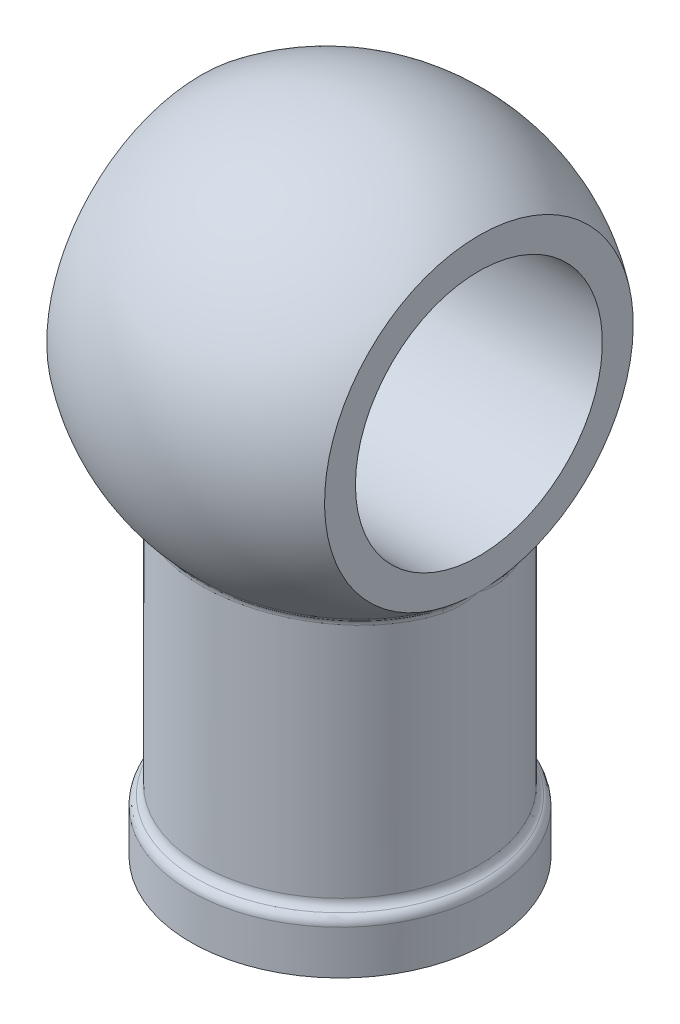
ISO-10303-21;
HEADER;
FILE_DESCRIPTION(('STEP AP214'),'2;1');
FILE_NAME('part.step','',(''),(''),'','','');
FILE_SCHEMA(('AUTOMOTIVE_DESIGN { 1 0 10303 214 1 1 1 1 }'));
ENDSEC;
DATA;
#1=APPLICATION_CONTEXT('core data for automotive mechanical design processes');
#2=APPLICATION_PROTOCOL_DEFINITION('international standard','automotive_design',2000,#1);
#3=PRODUCT_CONTEXT('',#1,'mechanical');
#4=PRODUCT('Part','Part','',(#3));
#5=PRODUCT_RELATED_PRODUCT_CATEGORY('part','',(#4));
#6=PRODUCT_DEFINITION_FORMATION('','',#4);
#7=PRODUCT_DEFINITION_CONTEXT('part definition',#1,'design');
#8=PRODUCT_DEFINITION('design','',#6,#7);
#9=PRODUCT_DEFINITION_SHAPE('','',#8);
#10=(LENGTH_UNIT() NAMED_UNIT(*) SI_UNIT(.MILLI.,.METRE.));
#11=(NAMED_UNIT(*) PLANE_ANGLE_UNIT() SI_UNIT($,.RADIAN.));
#12=(NAMED_UNIT(*) SI_UNIT($,.STERADIAN.) SOLID_ANGLE_UNIT());
#13=UNCERTAINTY_MEASURE_WITH_UNIT(LENGTH_MEASURE(1.E-05),#10,'distance_accuracy_value','');
#14=(GEOMETRIC_REPRESENTATION_CONTEXT(3) GLOBAL_UNCERTAINTY_ASSIGNED_CONTEXT((#13)) GLOBAL_UNIT_ASSIGNED_CONTEXT((#10,
#11,#12)) REPRESENTATION_CONTEXT('',''));
#15=CARTESIAN_POINT('',(0.,0.,0.));
#16=DIRECTION('',(0.,0.,1.));
#17=DIRECTION('',(1.,0.,0.));
#18=AXIS2_PLACEMENT_3D('',#15,#16,#17);
#19=CARTESIAN_POINT('',(0.,500000.,0.));
#20=DIRECTION('',(0.,-1.,0.));
#21=DIRECTION('',(0.,0.,-1.));
#22=AXIS2_PLACEMENT_3D('',#19,#20,#21);
#23=CYLINDRICAL_SURFACE('',#22,42.8625);
#24=CARTESIAN_POINT('',(0.,-120.650000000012,0.));
#25=DIRECTION('',(0.,-1.,0.));
#26=DIRECTION('',(0.,0.,-1.));
#27=AXIS2_PLACEMENT_3D('',#24,#25,#26);
#28=CIRCLE('',#27,42.8625);
#29=CARTESIAN_POINT('',(0.,-120.650000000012,-42.8625));
#30=VERTEX_POINT('',#29);
#31=EDGE_CURVE('E137',#30,#30,#28,.F.);
#32=ORIENTED_EDGE('',*,*,#31,.T.);
#33=EDGE_LOOP('',(#32));
#34=FACE_BOUND('',#33,.T.);
#35=CARTESIAN_POINT('',(-40.2656905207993,-48.2619603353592,14.6924495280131));
#36=CARTESIAN_POINT('',(-40.4870677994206,-45.8065159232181,14.0857495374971));
#37=CARTESIAN_POINT('',(-42.8625,-45.2665556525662,14.8013365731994));
#38=CARTESIAN_POINT('',(-40.3583971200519,-48.338349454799,14.4383961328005));
#39=CARTESIAN_POINT('',(-40.5567997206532,-45.9382764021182,13.8829145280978));
#40=CARTESIAN_POINT('',(-42.8625,-45.3490761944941,14.548962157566));
#41=CARTESIAN_POINT('',(-40.449207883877,-48.4082993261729,14.1820381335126));
#42=CARTESIAN_POINT('',(-40.6278661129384,-46.0643687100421,13.6717428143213));
#43=CARTESIAN_POINT('',(-42.8625,-45.4296543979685,14.2953902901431));
#44=CARTESIAN_POINT('',(-40.6266808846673,-48.5359092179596,13.6653295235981));
#45=CARTESIAN_POINT('',(-40.76986350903,-46.3023013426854,13.238791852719));
#46=CARTESIAN_POINT('',(-42.8625,-45.5868549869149,13.7858760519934));
#47=CARTESIAN_POINT('',(-40.713344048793,-48.5935719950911,13.4049798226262));
#48=CARTESIAN_POINT('',(-40.8408850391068,-46.4145596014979,13.0169457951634));
#49=CARTESIAN_POINT('',(-42.8625,-45.6634782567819,13.5299342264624));
#50=CARTESIAN_POINT('',(-40.9663631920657,-48.7488902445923,12.619549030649));
#51=CARTESIAN_POINT('',(-41.0501635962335,-46.7278670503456,12.3440966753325));
#52=CARTESIAN_POINT('',(-42.8625,-45.8871200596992,12.7592578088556));
#53=CARTESIAN_POINT('',(-41.1260530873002,-48.8291205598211,12.089254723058));
#54=CARTESIAN_POINT('',(-41.1890919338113,-46.9133722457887,11.8728205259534));
#55=CARTESIAN_POINT('',(-42.8625,-46.028179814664,12.2408500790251));
#56=CARTESIAN_POINT('',(-41.4247978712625,-48.9470568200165,11.0220549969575));
#57=CARTESIAN_POINT('',(-41.4548379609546,-47.2330692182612,10.906271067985));
#58=CARTESIAN_POINT('',(-42.8625,-46.2930299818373,11.1975101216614));
#59=CARTESIAN_POINT('',(-41.5639565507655,-48.984983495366,10.4851988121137));
#60=CARTESIAN_POINT('',(-41.5825520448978,-47.3695472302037,10.4099742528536));
#61=CARTESIAN_POINT('',(-42.8625,-46.4169070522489,10.6726263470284));
#62=CARTESIAN_POINT('',(-41.8215774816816,-49.0230573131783,9.40520941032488));
#63=CARTESIAN_POINT('',(-41.8226536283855,-47.5977854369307,9.39802900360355));
#64=CARTESIAN_POINT('',(-42.8625,-46.6477583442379,9.61358953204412));
#65=CARTESIAN_POINT('',(-41.9400302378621,-49.0231871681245,8.86207343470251));
#66=CARTESIAN_POINT('',(-41.9358461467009,-47.690992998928,8.88088705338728));
#67=CARTESIAN_POINT('',(-42.8625,-46.7547248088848,9.07943236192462));
#68=CARTESIAN_POINT('',(-42.184306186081,-48.9847458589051,7.62712051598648));
#69=CARTESIAN_POINT('',(-42.1712305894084,-47.8563935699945,7.6961237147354));
#70=CARTESIAN_POINT('',(-42.8625,-46.977280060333,7.85854507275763));
#71=CARTESIAN_POINT('',(-42.3036632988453,-48.9358394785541,6.93429909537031));
#72=CARTESIAN_POINT('',(-42.2898191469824,-47.9187048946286,7.01836175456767));
#73=CARTESIAN_POINT('',(-42.8625,-47.0875544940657,7.16913284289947));
#74=CARTESIAN_POINT('',(-42.5077085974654,-48.7899183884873,5.54796120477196));
#75=CARTESIAN_POINT('',(-42.4940623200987,-47.9874938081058,5.65050732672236));
#76=CARTESIAN_POINT('',(-42.8625,-47.2785645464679,5.77683476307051));
#77=CARTESIAN_POINT('',(-42.5923893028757,-48.6928933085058,4.85444461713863));
#78=CARTESIAN_POINT('',(-42.5808616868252,-47.9951285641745,4.95676477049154));
#79=CARTESIAN_POINT('',(-42.8625,-47.359293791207,5.07394604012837));
#80=CARTESIAN_POINT('',(-42.7274511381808,-48.4567692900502,3.47024469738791));
#81=CARTESIAN_POINT('',(-42.7198698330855,-47.9629227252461,3.56358743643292));
#82=CARTESIAN_POINT('',(-42.8625,-47.4898316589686,3.65565311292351));
#83=CARTESIAN_POINT('',(-42.7778244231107,-48.3176607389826,2.77956204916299));
#84=CARTESIAN_POINT('',(-42.7728625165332,-47.9235316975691,2.8603043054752));
#85=CARTESIAN_POINT('',(-42.8625,-47.5396332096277,2.94024608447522));
#86=CARTESIAN_POINT('',(-42.8450256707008,-48.0028920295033,1.40411658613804));
#87=CARTESIAN_POINT('',(-42.843626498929,-47.8050131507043,1.45343741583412));
#88=CARTESIAN_POINT('',(-42.8625,-47.6068826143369,1.4985630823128));
#89=CARTESIAN_POINT('',(-42.8618687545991,-47.8272483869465,0.71935124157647));
#90=CARTESIAN_POINT('',(-42.8618216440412,-47.7258005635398,0.74586060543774));
#91=CARTESIAN_POINT('',(-42.8625,-47.6243450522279,0.772292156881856));
#92=CARTESIAN_POINT('',(-42.862488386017,-47.6340718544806,0.0322049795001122));
#93=CARTESIAN_POINT('',(-42.8624875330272,-47.6295298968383,0.0333945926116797));
#94=CARTESIAN_POINT('',(-42.8625,-47.624987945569,0.0345842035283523));
#95=CARTESIAN_POINT('',(-42.8624927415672,-47.6322593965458,0.0257632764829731));
#96=CARTESIAN_POINT('',(-42.8624922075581,-47.6286259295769,0.0267154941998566));
#97=CARTESIAN_POINT('',(-42.8625,-47.6249924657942,0.0276677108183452));
#98=CARTESIAN_POINT('',(-42.8624985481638,-47.6286317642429,0.0128809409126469));
#99=CARTESIAN_POINT('',(-42.8624984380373,-47.6268151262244,0.0133576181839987));
#100=CARTESIAN_POINT('',(-42.8625,-47.6249984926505,0.0138342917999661));
#101=CARTESIAN_POINT('',(-42.8624999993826,-47.6268165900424,0.00644030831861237));
#102=CARTESIAN_POINT('',(-42.8624999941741,-47.6259082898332,0.00667883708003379));
#103=CARTESIAN_POINT('',(-42.8625,-47.6249999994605,0.0069173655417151));
#104=CARTESIAN_POINT('',(-42.8625,-47.625,0.));
#105=CARTESIAN_POINT('',(-42.8625,-47.625,0.));
#106=CARTESIAN_POINT('',(-42.8625,-47.6250000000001,1.61978618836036E-13));
#107=(BOUNDED_SURFACE() B_SPLINE_SURFACE(3,2,((#35,#36,#37),(#38,#39,#40),(#41,#42,#43),(#44,
#45,#46),(#47,#48,#49),(#50,#51,#52),(#53,#54,#55),(#56,#57,#58),(#59,#60,#61),(#62,#63,#64),
(#65,#66,#67),(#68,#69,#70),(#71,#72,#73),(#74,#75,#76),(#77,#78,#79),(#80,#81,#82),(#83,#84,
#85),(#86,#87,#88),(#89,#90,#91),(#92,#93,#94),(#95,#96,#97),(#98,#99,#100),(#101,#102,#103),
(#104,#105,#106)),.UNSPECIFIED.,.F.,.F.,.F.) B_SPLINE_SURFACE_WITH_KNOTS((4,2,2,2,2,2,2,2,2,2,2,
4),(3,3),(0.,0.900849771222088,1.80149721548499,3.59985656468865,5.38878795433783,
7.17853756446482,9.44581734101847,11.7135859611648,13.9818729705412,16.2491368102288,
16.2705938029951,16.2920495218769),(0.,1.),
.UNSPECIFIED.) GEOMETRIC_REPRESENTATION_ITEM() RATIONAL_B_SPLINE_SURFACE(((1.,0.780994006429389,
1.),(1.,0.789213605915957,1.),(1.,0.797164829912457,1.),(1.,0.812553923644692,1.),(1.,
0.819991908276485,1.),(1.,0.841552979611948,1.),(1.,0.854949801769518,1.),(1.,0.879845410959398,
1.),(1.,0.891353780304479,1.),(1.,0.912626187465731,1.),(1.,0.922389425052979,1.),(1.,
0.942571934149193,1.),(1.,0.952471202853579,1.),(1.,0.969518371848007,1.),(1.,0.976665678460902,
1.),(1.,0.988177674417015,1.),(1.,0.992541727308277,1.),(1.,0.998423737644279,1.),(1.,
0.999942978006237,1.),(1.,0.999998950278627,1.),(1.,0.999999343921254,1.),(1.,0.999999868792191,
1.),(1.,1.00000000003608,1.),(1.,1.,1.))) REPRESENTATION_ITEM('') SURFACE());
#108=CARTESIAN_POINT('',(-40.2656905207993,-48.2619603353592,14.6924495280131));
#109=CARTESIAN_POINT('',(-40.3583971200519,-48.338349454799,14.4383961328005));
#110=CARTESIAN_POINT('',(-40.449207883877,-48.4082993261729,14.1820381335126));
#111=CARTESIAN_POINT('',(-40.6266808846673,-48.5359092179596,13.6653295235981));
#112=CARTESIAN_POINT('',(-40.713344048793,-48.5935719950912,13.4049798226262));
#113=CARTESIAN_POINT('',(-40.9663631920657,-48.7488902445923,12.619549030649));
#114=CARTESIAN_POINT('',(-41.1260530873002,-48.8291205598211,12.089254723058));
#115=CARTESIAN_POINT('',(-41.4247978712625,-48.9470568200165,11.0220549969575));
#116=CARTESIAN_POINT('',(-41.5639565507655,-48.984983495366,10.4851988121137));
#117=CARTESIAN_POINT('',(-41.8215774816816,-49.0230573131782,9.40520941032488));
#118=CARTESIAN_POINT('',(-41.9400302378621,-49.0231871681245,8.86207343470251));
#119=CARTESIAN_POINT('',(-42.184306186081,-48.9847458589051,7.62712051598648));
#120=CARTESIAN_POINT('',(-42.3036632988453,-48.9358394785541,6.93429909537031));
#121=CARTESIAN_POINT('',(-42.5077085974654,-48.7899183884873,5.54796120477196));
#122=CARTESIAN_POINT('',(-42.5923893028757,-48.6928933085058,4.85444461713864));
#123=CARTESIAN_POINT('',(-42.7274511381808,-48.4567692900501,3.47024469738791));
#124=CARTESIAN_POINT('',(-42.7778244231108,-48.3176607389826,2.77956204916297));
#125=CARTESIAN_POINT('',(-42.8450256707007,-48.0028920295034,1.40411658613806));
#126=CARTESIAN_POINT('',(-42.861868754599,-47.8272483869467,0.71935124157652));
#127=CARTESIAN_POINT('',(-42.862488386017,-47.6340718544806,0.0322049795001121));
#128=CARTESIAN_POINT('',(-42.8624927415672,-47.6322593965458,0.0257632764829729));
#129=CARTESIAN_POINT('',(-42.8624985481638,-47.6286317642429,0.0128809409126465));
#130=CARTESIAN_POINT('',(-42.8624999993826,-47.6268165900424,0.00644030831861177));
#131=CARTESIAN_POINT('',(-42.8625,-47.625,0.));
#132=B_SPLINE_CURVE_WITH_KNOTS('',3,(#108,#109,#110,#111,#112,#113,#114,#115,#116,#117,#118,
#119,#120,#121,#122,#123,#124,#125,#126,#127,#128,#129,#130,#131),.UNSPECIFIED.,.F.,.F.,(4,2,2,
2,2,2,2,2,2,2,2,4),(0.,0.900849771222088,1.80149721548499,3.59985656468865,5.38878795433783,
7.17853756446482,9.44581734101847,11.7135859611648,13.9818729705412,16.2491368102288,
16.2705938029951,16.2920495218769),.UNSPECIFIED.);
#133=CARTESIAN_POINT('',(-41.6800862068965,-49.00209051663,9.99821584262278));
#134=VERTEX_POINT('',#133);
#135=CARTESIAN_POINT('',(-42.8625,-47.625,0.));
#136=VERTEX_POINT('',#135);
#137=EDGE_CURVE('E141',#134,#136,#132,.T.);
#138=ORIENTED_EDGE('',*,*,#137,.T.);
#139=CARTESIAN_POINT('',(-42.8625,-45.266555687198,-14.8013364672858));
#140=CARTESIAN_POINT('',(-40.4870678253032,-45.8065159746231,-14.085749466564));
#141=CARTESIAN_POINT('',(-40.2656905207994,-48.2619603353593,-14.6924495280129));
#142=CARTESIAN_POINT('',(-42.8625,-45.3490762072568,-14.5489621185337));
#143=CARTESIAN_POINT('',(-40.5567997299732,-45.9382764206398,-13.8829145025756));
#144=CARTESIAN_POINT('',(-40.358397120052,-48.338349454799,-14.4383961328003));
#145=CARTESIAN_POINT('',(-42.8625,-45.4296544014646,-14.2953902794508));
#146=CARTESIAN_POINT('',(-40.627866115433,-46.0643687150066,-13.6717428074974));
#147=CARTESIAN_POINT('',(-40.4492078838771,-48.4082993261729,-14.1820381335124));
#148=CARTESIAN_POINT('',(-42.8625,-45.5868549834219,-13.7858760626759));
#149=CARTESIAN_POINT('',(-40.7698635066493,-46.3023013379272,-13.2387918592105));
#150=CARTESIAN_POINT('',(-40.6266808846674,-48.5359092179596,-13.6653295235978));
#151=CARTESIAN_POINT('',(-42.8625,-45.6634782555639,-13.5299342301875));
#152=CARTESIAN_POINT('',(-40.8408850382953,-46.4145595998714,-13.0169457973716));
#153=CARTESIAN_POINT('',(-40.7133440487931,-48.5935719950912,-13.404979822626));
#154=CARTESIAN_POINT('',(-42.8625,-45.8871200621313,-12.7592578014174));
#155=CARTESIAN_POINT('',(-41.0501635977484,-46.7278670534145,-12.3440966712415));
#156=CARTESIAN_POINT('',(-40.9663631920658,-48.7488902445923,-12.6195490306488));
#157=CARTESIAN_POINT('',(-42.8625,-46.0281798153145,-12.2408500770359));
#158=CARTESIAN_POINT('',(-41.189091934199,-46.9133722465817,-11.8728205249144));
#159=CARTESIAN_POINT('',(-41.1260530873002,-48.8291205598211,-12.0892547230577));
#160=CARTESIAN_POINT('',(-42.8625,-46.2930299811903,-11.1975101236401));
#161=CARTESIAN_POINT('',(-41.4548379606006,-47.2330692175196,-10.9062710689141));
#162=CARTESIAN_POINT('',(-41.4247978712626,-48.9470568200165,-11.0220549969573));
#163=CARTESIAN_POINT('',(-42.8625,-46.4169070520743,-10.6726263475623));
#164=CARTESIAN_POINT('',(-41.5825520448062,-47.3695472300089,-10.4099742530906));
#165=CARTESIAN_POINT('',(-41.5639565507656,-48.984983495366,-10.4851988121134));
#166=CARTESIAN_POINT('',(-42.8625,-46.6477583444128,-9.61358953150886));
#167=CARTESIAN_POINT('',(-41.8226536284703,-47.5977854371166,-9.39802900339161));
#168=CARTESIAN_POINT('',(-41.8215774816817,-49.0230573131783,-9.40520941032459));
#169=CARTESIAN_POINT('',(-42.8625,-46.7547248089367,-9.07943236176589));
#170=CARTESIAN_POINT('',(-41.9358461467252,-47.690992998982,-8.88088705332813));
#171=CARTESIAN_POINT('',(-41.9400302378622,-49.0231871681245,-8.86207343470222));
#172=CARTESIAN_POINT('',(-42.8625,-46.9772800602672,-7.85854507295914));
#173=CARTESIAN_POINT('',(-42.1712305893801,-47.8563935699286,-7.69612371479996));
#174=CARTESIAN_POINT('',(-42.1843061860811,-48.9847458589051,-7.62712051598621));
#175=CARTESIAN_POINT('',(-42.8625,-47.0875544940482,-7.16913284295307));
#176=CARTESIAN_POINT('',(-42.2898191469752,-47.9187048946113,-7.01836175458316));
#177=CARTESIAN_POINT('',(-42.3036632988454,-48.935839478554,-6.93429909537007));
#178=CARTESIAN_POINT('',(-42.8625,-47.2785645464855,-5.77683476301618));
#179=CARTESIAN_POINT('',(-42.4940623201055,-47.9874938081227,-5.65050732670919));
#180=CARTESIAN_POINT('',(-42.5077085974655,-48.7899183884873,-5.54796120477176));
#181=CARTESIAN_POINT('',(-42.8625,-47.3592937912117,-5.07394604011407));
#182=CARTESIAN_POINT('',(-42.5808616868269,-47.995128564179,-4.95676477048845));
#183=CARTESIAN_POINT('',(-42.5923893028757,-48.6928933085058,-4.85444461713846));
#184=CARTESIAN_POINT('',(-42.8625,-47.4898316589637,-3.65565311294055));
#185=CARTESIAN_POINT('',(-42.7198698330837,-47.9629227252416,-3.56358743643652));
#186=CARTESIAN_POINT('',(-42.7274511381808,-48.4567692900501,-3.47024469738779));
#187=CARTESIAN_POINT('',(-42.8625,-47.5396332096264,-2.94024608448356));
#188=CARTESIAN_POINT('',(-42.7728625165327,-47.9235316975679,-2.86030430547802));
#189=CARTESIAN_POINT('',(-42.7778244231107,-48.3176607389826,-2.77956204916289));
#190=CARTESIAN_POINT('',(-42.8625,-47.606882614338,-1.49856308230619));
#191=CARTESIAN_POINT('',(-42.8436264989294,-47.8050131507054,-1.45343741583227));
#192=CARTESIAN_POINT('',(-42.8450256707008,-48.0028920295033,-1.40411658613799));
#193=CARTESIAN_POINT('',(-42.8625,-47.6243450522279,-0.772292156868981));
#194=CARTESIAN_POINT('',(-42.8618216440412,-47.7258005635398,-0.745860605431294));
#195=CARTESIAN_POINT('',(-42.8618687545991,-47.8272483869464,-0.719351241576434));
#196=CARTESIAN_POINT('',(-42.8625,-47.624987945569,-0.0345842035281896));
#197=CARTESIAN_POINT('',(-42.8624875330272,-47.6295298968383,-0.0333945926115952));
#198=CARTESIAN_POINT('',(-42.862488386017,-47.6340718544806,-0.0322049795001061));
#199=CARTESIAN_POINT('',(-42.8625,-47.6249924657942,-0.0276677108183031));
#200=CARTESIAN_POINT('',(-42.8624922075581,-47.6286259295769,-0.0267154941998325));
#201=CARTESIAN_POINT('',(-42.8624927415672,-47.6322593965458,-0.0257632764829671));
#202=CARTESIAN_POINT('',(-42.8625,-47.6249984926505,-0.0138342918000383));
#203=CARTESIAN_POINT('',(-42.8624984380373,-47.6268151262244,-0.0133576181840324));
#204=CARTESIAN_POINT('',(-42.8624985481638,-47.6286317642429,-0.012880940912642));
#205=CARTESIAN_POINT('',(-42.8625,-47.6249999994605,-0.00691736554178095));
#206=CARTESIAN_POINT('',(-42.8624999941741,-47.6259082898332,-0.00667883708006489));
#207=CARTESIAN_POINT('',(-42.8624999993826,-47.6268165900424,-0.00644030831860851));
#208=CARTESIAN_POINT('',(-42.8625,-47.6250000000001,0.));
#209=CARTESIAN_POINT('',(-42.8625,-47.625,0.));
#210=CARTESIAN_POINT('',(-42.8625,-47.625,0.));
#211=(BOUNDED_SURFACE() B_SPLINE_SURFACE(3,2,((#139,#140,#141),(#142,#143,#144),(#145,#146,
#147),(#148,#149,#150),(#151,#152,#153),(#154,#155,#156),(#157,#158,#159),(#160,#161,#162),
(#163,#164,#165),(#166,#167,#168),(#169,#170,#171),(#172,#173,#174),(#175,#176,#177),(#178,#179,
#180),(#181,#182,#183),(#184,#185,#186),(#187,#188,#189),(#190,#191,#192),(#193,#194,#195),
(#196,#197,#198),(#199,#200,#201),(#202,#203,#204),(#205,#206,#207),(#208,#209,#210)),
.UNSPECIFIED.,.F.,.F.,.F.) B_SPLINE_SURFACE_WITH_KNOTS((4,2,2,2,2,2,2,2,2,2,2,4),(3,3),(0.,
0.900849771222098,1.80149721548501,3.59985656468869,5.38878795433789,7.1785375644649,
9.44581734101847,11.7135859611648,13.9818729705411,16.2491368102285,16.2705938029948,
16.2920495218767),(0.,1.),
.UNSPECIFIED.) GEOMETRIC_REPRESENTATION_ITEM() RATIONAL_B_SPLINE_SURFACE(((1.,0.780994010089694,
1.),(1.,0.789213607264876,1.),(1.,0.797164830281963,1.),(1.,0.812553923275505,1.),(1.,
0.819991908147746,1.),(1.,0.84155297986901,1.),(1.,0.854949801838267,1.),(1.,0.879845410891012,
1.),(1.,0.891353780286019,1.),(1.,0.912626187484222,1.),(1.,0.922389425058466,1.),(1.,
0.942571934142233,1.),(1.,0.952471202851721,1.),(1.,0.969518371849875,1.),(1.,0.976665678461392,
1.),(1.,0.988177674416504,1.),(1.,0.992541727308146,1.),(1.,0.998423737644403,1.),(1.,
0.999942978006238,1.),(1.,0.999998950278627,1.),(1.,0.999999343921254,1.),(1.,0.999999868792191,
1.),(1.,1.00000000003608,1.),(1.,1.,1.))) REPRESENTATION_ITEM('') SURFACE());
#212=CARTESIAN_POINT('',(-40.2656905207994,-48.2619603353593,-14.6924495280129));
#213=CARTESIAN_POINT('',(-40.358397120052,-48.338349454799,-14.4383961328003));
#214=CARTESIAN_POINT('',(-40.4492078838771,-48.4082993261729,-14.1820381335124));
#215=CARTESIAN_POINT('',(-40.6266808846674,-48.5359092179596,-13.6653295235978));
#216=CARTESIAN_POINT('',(-40.713344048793,-48.5935719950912,-13.404979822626));
#217=CARTESIAN_POINT('',(-40.9663631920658,-48.7488902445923,-12.6195490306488));
#218=CARTESIAN_POINT('',(-41.1260530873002,-48.8291205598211,-12.0892547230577));
#219=CARTESIAN_POINT('',(-41.4247978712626,-48.9470568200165,-11.0220549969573));
#220=CARTESIAN_POINT('',(-41.5639565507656,-48.984983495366,-10.4851988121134));
#221=CARTESIAN_POINT('',(-41.8215774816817,-49.0230573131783,-9.4052094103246));
#222=CARTESIAN_POINT('',(-41.9400302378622,-49.0231871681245,-8.86207343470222));
#223=CARTESIAN_POINT('',(-42.1843061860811,-48.9847458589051,-7.62712051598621));
#224=CARTESIAN_POINT('',(-42.3036632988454,-48.935839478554,-6.93429909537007));
#225=CARTESIAN_POINT('',(-42.5077085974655,-48.7899183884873,-5.54796120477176));
#226=CARTESIAN_POINT('',(-42.5923893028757,-48.6928933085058,-4.85444461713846));
#227=CARTESIAN_POINT('',(-42.7274511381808,-48.4567692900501,-3.47024469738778));
#228=CARTESIAN_POINT('',(-42.7778244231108,-48.3176607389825,-2.77956204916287));
#229=CARTESIAN_POINT('',(-42.8450256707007,-48.0028920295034,-1.404116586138));
#230=CARTESIAN_POINT('',(-42.861868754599,-47.8272483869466,-0.719351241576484));
#231=CARTESIAN_POINT('',(-42.862488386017,-47.6340718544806,-0.032204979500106));
#232=CARTESIAN_POINT('',(-42.8624927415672,-47.6322593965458,-0.0257632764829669));
#233=CARTESIAN_POINT('',(-42.8624985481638,-47.6286317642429,-0.0128809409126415));
#234=CARTESIAN_POINT('',(-42.8624999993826,-47.6268165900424,-0.0064403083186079));
#235=CARTESIAN_POINT('',(-42.8625,-47.625,0.));
#236=B_SPLINE_CURVE_WITH_KNOTS('',3,(#212,#213,#214,#215,#216,#217,#218,#219,#220,#221,#222,
#223,#224,#225,#226,#227,#228,#229,#230,#231,#232,#233,#234,#235),.UNSPECIFIED.,.F.,.F.,(4,2,2,
2,2,2,2,2,2,2,2,4),(0.,0.900849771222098,1.80149721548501,3.59985656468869,5.38878795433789,
7.1785375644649,9.44581734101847,11.7135859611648,13.9818729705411,16.2491368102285,
16.2705938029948,16.2920495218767),.UNSPECIFIED.);
#237=CARTESIAN_POINT('',(-41.6800862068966,-49.00209051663,-9.99821584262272));
#238=VERTEX_POINT('',#237);
#239=EDGE_CURVE('E217',#136,#238,#236,.F.);
#240=ORIENTED_EDGE('',*,*,#239,.T.);
#241=CARTESIAN_POINT('',(-42.5933205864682,-49.1473511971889,4.79613882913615));
#242=CARTESIAN_POINT('',(-42.5962233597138,-47.606126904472,4.77036001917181));
#243=CARTESIAN_POINT('',(-43.8016417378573,-46.6528637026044,4.88994720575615));
#244=CARTESIAN_POINT('',(-42.6628326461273,-49.1585867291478,4.17883070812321));
#245=CARTESIAN_POINT('',(-42.665001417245,-47.6163548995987,4.15617446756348));
#246=CARTESIAN_POINT('',(-43.8731257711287,-46.6630558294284,4.26051527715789));
#247=CARTESIAN_POINT('',(-42.71891575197,-49.1676828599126,3.56005170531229));
#248=CARTESIAN_POINT('',(-42.7204784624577,-47.6246319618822,3.54069929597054));
#249=CARTESIAN_POINT('',(-43.9307998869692,-46.6713055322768,3.62961252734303));
#250=CARTESIAN_POINT('',(-42.8041418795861,-49.1815306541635,2.3206147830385));
#251=CARTESIAN_POINT('',(-42.8047834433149,-47.6372317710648,2.30790974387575));
#252=CARTESIAN_POINT('',(-44.018443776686,-46.6838633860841,2.36592687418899));
#253=CARTESIAN_POINT('',(-42.8332855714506,-49.1862824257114,1.69995691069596));
#254=CARTESIAN_POINT('',(-42.8336043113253,-47.6415534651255,1.69065129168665));
#255=CARTESIAN_POINT('',(-44.0484142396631,-46.6881716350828,1.7331440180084));
#256=CARTESIAN_POINT('',(-42.8801786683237,-49.1939217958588,-0.16289822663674));
#257=CARTESIAN_POINT('',(-42.8799894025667,-47.6485034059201,-0.162086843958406));
#258=CARTESIAN_POINT('',(-44.0966376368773,-46.6950983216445,-0.166083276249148));
#259=CARTESIAN_POINT('',(-42.8574337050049,-49.1902005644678,-1.40636475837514));
#260=CARTESIAN_POINT('',(-42.857503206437,-47.6451205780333,-1.39846999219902));
#261=CARTESIAN_POINT('',(-44.0732474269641,-46.6917251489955,-1.43380177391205));
#262=CARTESIAN_POINT('',(-42.7041095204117,-49.1652690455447,-3.88494397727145));
#263=CARTESIAN_POINT('',(-42.7058410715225,-47.6224372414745,-3.86371367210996));
#264=CARTESIAN_POINT('',(-43.9155736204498,-46.6691169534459,-3.96085203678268));
#265=CARTESIAN_POINT('',(-42.5736624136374,-49.1440801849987,-5.12006503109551));
#266=CARTESIAN_POINT('',(-42.5768517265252,-47.6031645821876,-5.09212975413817));
#267=CARTESIAN_POINT('',(-43.7814258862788,-46.6499013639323,-5.22019217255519));
#268=CARTESIAN_POINT('',(-42.2981719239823,-49.099883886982,-6.96013901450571));
#269=CARTESIAN_POINT('',(-42.3041765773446,-47.562904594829,-6.92334949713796));
#270=CARTESIAN_POINT('',(-43.4981200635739,-46.6097919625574,-7.09656746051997));
#271=CARTESIAN_POINT('',(-42.193031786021,-49.083081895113,-7.57142356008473));
#272=CARTESIAN_POINT('',(-42.2001235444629,-47.5475982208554,-7.53166663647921));
#273=CARTESIAN_POINT('',(-43.3899972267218,-46.5945401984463,-7.71994844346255));
#274=CARTESIAN_POINT('',(-41.9563279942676,-49.0455127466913,-8.78892098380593));
#275=CARTESIAN_POINT('',(-41.965792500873,-47.513352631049,-8.74351955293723));
#276=CARTESIAN_POINT('',(-43.1465784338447,-46.5604242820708,-8.96162856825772));
#277=CARTESIAN_POINT('',(-41.8247571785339,-49.0247445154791,-9.395132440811));
#278=CARTESIAN_POINT('',(-41.8355267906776,-47.4944151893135,-9.34700825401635));
#279=CARTESIAN_POINT('',(-43.0112751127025,-46.5415591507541,-9.57992628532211));
#280=CARTESIAN_POINT('',(-41.3907270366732,-48.9567798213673,-11.2044544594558));
#281=CARTESIAN_POINT('',(-41.4057578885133,-47.4324149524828,-11.1482471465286));
#282=CARTESIAN_POINT('',(-42.5649320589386,-46.4797952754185,-11.4254801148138));
#283=CARTESIAN_POINT('',(-41.0489610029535,-48.9039251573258,-12.3981793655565));
#284=CARTESIAN_POINT('',(-41.067231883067,-47.3841561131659,-12.3372896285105));
#285=CARTESIAN_POINT('',(-42.2134705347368,-46.4317296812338,-12.6433221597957));
#286=CARTESIAN_POINT('',(-40.2633899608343,-48.7851653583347,-14.7509864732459));
#287=CARTESIAN_POINT('',(-40.288350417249,-47.2755273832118,-14.682390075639));
#288=CARTESIAN_POINT('',(-41.4056137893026,-46.3236076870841,-15.0441665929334));
#289=CARTESIAN_POINT('',(-39.8195840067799,-48.7192601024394,-15.9100683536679));
#290=CARTESIAN_POINT('',(-39.8482044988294,-47.2151842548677,-15.838216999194));
#291=CARTESIAN_POINT('',(-40.9492175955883,-46.2635511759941,-16.2271686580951));
#292=CARTESIAN_POINT('',(-39.0801357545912,-48.6124657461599,-17.6159398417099));
#293=CARTESIAN_POINT('',(-39.1138806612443,-47.1171881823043,-17.5410035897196));
#294=CARTESIAN_POINT('',(-40.188792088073,-46.1661146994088,-17.9686443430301));
#295=CARTESIAN_POINT('',(-38.8213352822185,-48.5755410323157,-18.1791565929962));
#296=CARTESIAN_POINT('',(-38.8568946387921,-47.0832938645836,-18.1031731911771));
#297=CARTESIAN_POINT('',(-39.9226497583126,-46.1324070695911,-18.5436842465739));
#298=CARTESIAN_POINT('',(-38.2797010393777,-48.4993823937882,-19.293577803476));
#299=CARTESIAN_POINT('',(-38.3188391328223,-47.0133271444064,-19.2158673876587));
#300=CARTESIAN_POINT('',(-39.365650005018,-46.0628421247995,-19.6816335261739));
#301=CARTESIAN_POINT('',(-37.9968738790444,-48.4601491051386,-19.8447855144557));
#302=CARTESIAN_POINT('',(-38.0378027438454,-46.9772580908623,-19.7663850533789));
#303=CARTESIAN_POINT('',(-39.0747993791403,-46.0269854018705,-20.2445461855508));
#304=CARTESIAN_POINT('',(-37.1129760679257,-48.3394689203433,-21.4791643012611));
#305=CARTESIAN_POINT('',(-37.1594719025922,-46.8662583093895,-21.3986213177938));
#306=CARTESIAN_POINT('',(-38.1658264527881,-45.9166239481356,-21.9138299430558));
#307=CARTESIAN_POINT('',(-36.4764263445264,-48.2550325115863,-22.5432357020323));
#308=CARTESIAN_POINT('',(-36.5263822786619,-46.7884568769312,-22.462375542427));
#309=CARTESIAN_POINT('',(-37.5112185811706,-45.8393195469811,-23.0008945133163));
#310=CARTESIAN_POINT('',(-35.1348508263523,-48.0837115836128,-24.5800283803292));
#311=CARTESIAN_POINT('',(-35.1908806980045,-46.6303231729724,-24.4998201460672));
#312=CARTESIAN_POINT('',(-36.1315841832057,-45.6822765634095,-25.0821771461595));
#313=CARTESIAN_POINT('',(-34.4325328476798,-47.9969822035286,-25.5545525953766));
#314=CARTESIAN_POINT('',(-34.4913866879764,-46.5501562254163,-25.4752736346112));
#315=CARTESIAN_POINT('',(-35.4093422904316,-45.6026859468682,-26.0782224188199));
#316=CARTESIAN_POINT('',(-32.9486973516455,-47.8212602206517,-27.4411589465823));
#317=CARTESIAN_POINT('',(-33.0123697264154,-46.38748461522,-27.3646455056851));
#318=CARTESIAN_POINT('',(-33.8834121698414,-45.4412466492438,-28.0068940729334));
#319=CARTESIAN_POINT('',(-32.1671815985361,-47.7322676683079,-28.3532424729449));
#320=CARTESIAN_POINT('',(-32.2329635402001,-46.3049827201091,-28.278669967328));
#321=CARTESIAN_POINT('',(-33.0797257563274,-45.3593980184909,-28.9395218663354));
#322=CARTESIAN_POINT('',(-30.5303159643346,-47.5545215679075,-30.1087060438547));
#323=CARTESIAN_POINT('',(-30.5993915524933,-46.139979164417,-30.0386445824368));
#324=CARTESIAN_POINT('',(-31.3964242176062,-45.1957518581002,-30.7348670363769));
#325=CARTESIAN_POINT('',(-29.6749598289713,-47.4657680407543,-30.9520802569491));
#326=CARTESIAN_POINT('',(-29.7452890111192,-46.0574731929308,-30.8847371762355));
#327=CARTESIAN_POINT('',(-30.5168026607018,-45.1139543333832,-31.5975784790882));
#328=CARTESIAN_POINT('',(-27.8963627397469,-47.2909026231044,-32.5642046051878));
#329=CARTESIAN_POINT('',(-27.9682397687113,-45.8947285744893,-32.502646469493));
#330=CARTESIAN_POINT('',(-28.6877489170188,-44.9526448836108,-33.2469435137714));
#331=CARTESIAN_POINT('',(-26.9731211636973,-47.2047907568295,-33.3329540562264));
#332=CARTESIAN_POINT('',(-27.0453142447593,-45.8144796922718,-33.2746383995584));
#333=CARTESIAN_POINT('',(-27.7383160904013,-44.873132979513,-34.0335964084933));
#334=CARTESIAN_POINT('',(-25.0591769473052,-47.0369291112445,-34.7949817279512));
#335=CARTESIAN_POINT('',(-25.131070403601,-45.657895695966,-34.743247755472));
#336=CARTESIAN_POINT('',(-25.7700755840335,-44.7180115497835,-35.5298909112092));
#337=CARTESIAN_POINT('',(-24.0680893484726,-46.9552098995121,-35.4877591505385));
#338=CARTESIAN_POINT('',(-24.1393268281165,-45.5815724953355,-35.4395635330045));
#339=CARTESIAN_POINT('',(-24.7508720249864,-44.6424294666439,-36.2390214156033));
#340=CARTESIAN_POINT('',(-22.0305894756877,-46.7988068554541,-36.7873225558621));
#341=CARTESIAN_POINT('',(-22.0996341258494,-45.4353815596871,-36.7460397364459));
#342=CARTESIAN_POINT('',(-22.6555707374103,-44.4976719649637,-37.5694252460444));
#343=CARTESIAN_POINT('',(-20.9841770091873,-46.7241230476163,-37.394108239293));
#344=CARTESIAN_POINT('',(-21.0516112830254,-45.3654959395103,-37.3563942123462));
#345=CARTESIAN_POINT('',(-21.579472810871,-44.4284965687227,-38.1906982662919));
#346=CARTESIAN_POINT('',(-18.8434782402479,-46.5836595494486,-38.5172446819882));
#347=CARTESIAN_POINT('',(-18.9069203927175,-45.2339766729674,-38.4862906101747));
#348=CARTESIAN_POINT('',(-19.3780449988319,-44.2983184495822,-39.3407664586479));
#349=CARTESIAN_POINT('',(-17.7491949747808,-46.5178792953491,-39.0336011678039));
#350=CARTESIAN_POINT('',(-17.8101389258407,-45.172323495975,-39.006022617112));
#351=CARTESIAN_POINT('',(-18.2527182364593,-44.2373152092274,-39.8695674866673));
#352=CARTESIAN_POINT('',(-15.5204698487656,-46.3968293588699,-39.9721266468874));
#353=CARTESIAN_POINT('',(-15.5757871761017,-45.0588186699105,-39.9507453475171));
#354=CARTESIAN_POINT('',(-15.9607668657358,-44.1250046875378,-40.8307887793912));
#355=CARTESIAN_POINT('',(-14.3860282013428,-46.3415596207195,-40.39429613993));
#356=CARTESIAN_POINT('',(-14.4380625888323,-45.0069485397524,-40.3759016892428));
#357=CARTESIAN_POINT('',(-14.7941424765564,-44.0736973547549,-41.2632095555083));
#358=CARTESIAN_POINT('',(-12.0903273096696,-46.2430903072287,-41.1396124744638));
#359=CARTESIAN_POINT('',(-12.1353432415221,-44.9145105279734,-41.1264909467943));
#360=CARTESIAN_POINT('',(-12.4333153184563,-43.982256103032,-42.0266694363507));
#361=CARTESIAN_POINT('',(-10.9292131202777,-46.1998370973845,-41.4631999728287));
#362=CARTESIAN_POINT('',(-10.9703150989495,-44.8738764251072,-41.4525031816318));
#363=CARTESIAN_POINT('',(-11.2392617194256,-43.9420725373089,-42.3581596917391));
#364=CARTESIAN_POINT('',(-8.58352544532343,-46.1260956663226,-42.0115187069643));
#365=CARTESIAN_POINT('',(-8.61651773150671,-44.8045919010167,-42.0048949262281));
#366=CARTESIAN_POINT('',(-8.82702971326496,-43.8735485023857,-42.9198922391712));
#367=CARTESIAN_POINT('',(-7.39895201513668,-46.0956074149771,-42.2362501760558));
#368=CARTESIAN_POINT('',(-7.42754015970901,-44.7759286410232,-42.2313789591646));
#369=CARTESIAN_POINT('',(-7.60885136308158,-43.8452080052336,-43.1501347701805));
#370=CARTESIAN_POINT('',(-5.01487008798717,-46.0481152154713,-42.5851660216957));
#371=CARTESIAN_POINT('',(-5.03455750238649,-44.7312804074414,-42.5829717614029));
#372=CARTESIAN_POINT('',(-5.15713590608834,-43.8010558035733,-43.507614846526));
#373=CARTESIAN_POINT('',(-3.8153617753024,-46.0311111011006,-42.7093516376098));
#374=CARTESIAN_POINT('',(-3.83032691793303,-44.71528671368,-42.7081497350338));
#375=CARTESIAN_POINT('',(-3.9235989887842,-43.7852439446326,-43.6348536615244));
#376=CARTESIAN_POINT('',(-1.41004869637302,-46.0109862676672,-42.8562413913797));
#377=CARTESIAN_POINT('',(-1.41566925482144,-44.6963608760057,-42.8561861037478));
#378=CARTESIAN_POINT('',(-1.45005007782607,-43.7665297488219,-43.7853554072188));
#379=CARTESIAN_POINT('',(-0.20424395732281,-46.0078654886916,-42.8789459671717));
#380=CARTESIAN_POINT('',(-0.205006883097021,-44.6934249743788,-42.8790739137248));
#381=CARTESIAN_POINT('',(-0.210038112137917,-43.7636273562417,-43.8086187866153));
#382=CARTESIAN_POINT('',(2.19687168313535,-46.0155542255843,-42.8228925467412));
#383=CARTESIAN_POINT('',(2.20550296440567,-44.7006560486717,-42.8225816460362));
#384=CARTESIAN_POINT('',(2.25919428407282,-43.7707774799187,-43.7511865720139));
#385=CARTESIAN_POINT('',(3.39219875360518,-46.0262705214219,-42.7448135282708));
#386=CARTESIAN_POINT('',(3.40560211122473,-44.7107367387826,-42.7438750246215));
#387=CARTESIAN_POINT('',(3.48843134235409,-43.780743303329,-43.6711866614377));
#388=CARTESIAN_POINT('',(5.77195437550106,-46.0612241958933,-42.4889469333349));
#389=CARTESIAN_POINT('',(5.79444240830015,-44.7436032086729,-42.4860263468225));
#390=CARTESIAN_POINT('',(5.93569776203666,-43.8132432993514,-43.4090334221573));
#391=CARTESIAN_POINT('',(6.95638298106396,-46.0854615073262,-42.3111598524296));
#392=CARTESIAN_POINT('',(6.98341000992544,-44.7663952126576,-42.3068352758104));
#393=CARTESIAN_POINT('',(7.15372717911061,-43.8357774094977,-43.2268806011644));
#394=CARTESIAN_POINT('',(9.3058880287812,-46.1468931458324,-41.8572081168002));
#395=CARTESIAN_POINT('',(9.34137276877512,-44.8241316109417,-41.8494543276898));
#396=CARTESIAN_POINT('',(9.56988485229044,-43.8928760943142,-42.7618044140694));
#397=CARTESIAN_POINT('',(10.4709652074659,-46.1840869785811,-41.5810472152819));
#398=CARTESIAN_POINT('',(10.5105816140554,-44.8590862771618,-41.5711819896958));
#399=CARTESIAN_POINT('',(10.7680138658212,-43.9274402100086,-42.4788848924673));
#400=CARTESIAN_POINT('',(12.7735840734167,-46.2705639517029,-40.9323853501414));
#401=CARTESIAN_POINT('',(12.820704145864,-44.9403019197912,-40.91781556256));
#402=CARTESIAN_POINT('',(13.1359552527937,-44.0077722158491,-41.8143928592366));
#403=CARTESIAN_POINT('',(13.9111257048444,-46.3198471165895,-40.5598841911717));
#404=CARTESIAN_POINT('',(13.9618099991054,-44.9865773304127,-40.5426016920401));
#405=CARTESIAN_POINT('',(14.305767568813,-44.053540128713,-41.4328201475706));
#406=CARTESIAN_POINT('',(16.1509583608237,-46.4293571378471,-39.7211641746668));
#407=CARTESIAN_POINT('',(16.2078993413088,-45.0893213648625,-39.6981439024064));
#408=CARTESIAN_POINT('',(16.6091415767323,-44.1551895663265,-40.5737492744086));
#409=CARTESIAN_POINT('',(17.2532407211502,-46.4895866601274,-39.2549224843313));
#410=CARTESIAN_POINT('',(17.313038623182,-45.1458094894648,-39.2287289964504));
#411=CARTESIAN_POINT('',(17.7426943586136,-44.2110735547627,-40.0962277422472));
#412=CARTESIAN_POINT('',(19.4145788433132,-46.6195481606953,-38.2321514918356));
#413=CARTESIAN_POINT('',(19.4791363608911,-45.2675850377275,-38.1994964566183));
#414=CARTESIAN_POINT('',(19.9653470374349,-44.3315870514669,-39.0488248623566));
#415=CARTESIAN_POINT('',(20.4736345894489,-46.6892801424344,-37.6756221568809));
#416=CARTESIAN_POINT('',(20.5402261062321,-45.3328907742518,-37.6395085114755));
#417=CARTESIAN_POINT('',(21.0544469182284,-44.3962165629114,-38.4789434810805));
#418=CARTESIAN_POINT('',(22.5413428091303,-46.8365718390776,-36.476163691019));
#419=CARTESIAN_POINT('',(22.6110049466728,-45.470688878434,-36.4332346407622));
#420=CARTESIAN_POINT('',(23.180813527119,-44.5326354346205,-37.2508655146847));
#421=CARTESIAN_POINT('',(23.5499877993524,-46.9141327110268,-35.8332217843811));
#422=CARTESIAN_POINT('',(23.6207786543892,-45.5432003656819,-35.7867516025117));
#423=CARTESIAN_POINT('',(24.2180725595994,-44.6044258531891,-36.5926558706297));
#424=CARTESIAN_POINT('',(25.5097675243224,-47.07515818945,-34.4655408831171));
#425=CARTESIAN_POINT('',(25.5818170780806,-45.6935681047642,-34.4123226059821));
#426=CARTESIAN_POINT('',(26.2334488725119,-44.7533519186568,-35.1927072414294));
#427=CARTESIAN_POINT('',(26.4609021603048,-47.1586228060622,-33.7408017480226));
#428=CARTESIAN_POINT('',(26.5331308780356,-45.7714405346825,-33.6841875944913));
#429=CARTESIAN_POINT('',(27.2115660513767,-44.8304875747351,-34.4509681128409));
#430=CARTESIAN_POINT('',(28.3056293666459,-47.3299406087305,-32.2091999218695));
#431=CARTESIAN_POINT('',(28.3772713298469,-45.9310785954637,-32.1463358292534));
#432=CARTESIAN_POINT('',(29.1086259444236,-44.9886723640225,-32.8837098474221));
#433=CARTESIAN_POINT('',(29.1987692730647,-47.4178205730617,-31.401794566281));
#434=CARTESIAN_POINT('',(29.2696327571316,-46.0128798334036,-31.3359026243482));
#435=CARTESIAN_POINT('',(30.0271031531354,-45.0697452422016,-32.0576372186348));
#436=CARTESIAN_POINT('',(30.913944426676,-47.5950852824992,-29.7147930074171));
#437=CARTESIAN_POINT('',(30.9823870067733,-46.1776581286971,-29.6436614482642));
#438=CARTESIAN_POINT('',(31.7909357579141,-45.2331164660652,-30.3319689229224));
#439=CARTESIAN_POINT('',(31.7359781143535,-47.6844700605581,-28.8351952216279));
#440=CARTESIAN_POINT('',(31.8027326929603,-46.2606427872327,-28.7616865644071));
#441=CARTESIAN_POINT('',(32.6362895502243,-45.3154148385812,-29.4323716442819));
#442=CARTESIAN_POINT('',(33.302938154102,-47.8622377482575,-27.0102611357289));
#443=CARTESIAN_POINT('',(33.3656115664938,-46.4254468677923,-26.9330284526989));
#444=CARTESIAN_POINT('',(34.2477023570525,-45.4789143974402,-27.5663446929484));
#445=CARTESIAN_POINT('',(34.0478907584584,-47.9506209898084,-26.0649474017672));
#446=CARTESIAN_POINT('',(34.1080787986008,-46.5072677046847,-25.9862372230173));
#447=CARTESIAN_POINT('',(35.0137883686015,-45.5601159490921,-26.5999379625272));
#448=CARTESIAN_POINT('',(35.4557750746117,-48.1238550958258,-24.1148897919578));
#449=CARTESIAN_POINT('',(35.510500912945,-46.6674071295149,-24.0344265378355));
#450=CARTESIAN_POINT('',(36.4616126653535,-45.719096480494,-24.606827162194));
#451=CARTESIAN_POINT('',(36.1187122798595,-48.2087061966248,-23.1101499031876));
#452=CARTESIAN_POINT('',(36.1703256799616,-46.7457196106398,-23.0293323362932));
#453=CARTESIAN_POINT('',(37.1433565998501,-45.7968756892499,-23.5801271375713));
#454=CARTESIAN_POINT('',(37.3004609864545,-48.3647128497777,-21.1438104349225));
#455=CARTESIAN_POINT('',(37.345842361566,-46.889491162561,-21.0636979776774));
#456=CARTESIAN_POINT('',(38.3586300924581,-45.9397198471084,-21.5712899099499));
#457=CARTESIAN_POINT('',(37.8269356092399,-48.43640887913,-20.1868422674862));
#458=CARTESIAN_POINT('',(37.8691652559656,-46.9554672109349,-20.1075275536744));
#459=CARTESIAN_POINT('',(38.9000401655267,-46.0052950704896,-20.593840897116));
#460=CARTESIAN_POINT('',(38.8054370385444,-48.5728828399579,-18.2352228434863));
#461=CARTESIAN_POINT('',(38.8413910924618,-47.0809007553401,-18.1585946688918));
#462=CARTESIAN_POINT('',(39.9063005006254,-46.1299947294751,-18.6008830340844));
#463=CARTESIAN_POINT('',(39.2574695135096,-48.6376612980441,-17.240574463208));
#464=CARTESIAN_POINT('',(39.2901568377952,-47.1403443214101,-17.1658800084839));
#465=CARTESIAN_POINT('',(40.3711565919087,-46.1891196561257,-17.5853770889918));
#466=CARTESIAN_POINT('',(40.0843784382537,-48.7585118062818,-15.2193514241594));
#467=CARTESIAN_POINT('',(40.1107970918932,-47.2511224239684,-15.149566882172));
#468=CARTESIAN_POINT('',(41.2215239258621,-46.299322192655,-15.5221945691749));
#469=CARTESIAN_POINT('',(40.4592613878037,-48.8145845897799,-14.1927794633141));
#470=CARTESIAN_POINT('',(40.4825296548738,-47.3024402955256,-14.1260755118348));
#471=CARTESIAN_POINT('',(41.6070418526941,-46.3504004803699,-14.4745207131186));
#472=CARTESIAN_POINT('',(41.1296646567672,-48.9164178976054,-12.1135462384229));
#473=CARTESIAN_POINT('',(41.1471290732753,-47.395556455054,-12.0539124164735));
#474=CARTESIAN_POINT('',(42.2964636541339,-46.4430900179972,-12.3529410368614));
#475=CARTESIAN_POINT('',(41.4251785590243,-48.9621775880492,-11.0608828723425));
#476=CARTESIAN_POINT('',(41.4398474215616,-47.4373356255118,-11.005404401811));
#477=CARTESIAN_POINT('',(42.6003609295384,-46.4847005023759,-11.279033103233));
#478=CARTESIAN_POINT('',(41.9691705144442,-49.047354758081,-8.79307207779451));
#479=CARTESIAN_POINT('',(41.9786572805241,-47.5150606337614,-8.74708554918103));
#480=CARTESIAN_POINT('',(43.15978528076,-46.5621066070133,-8.96581006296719));
#481=CARTESIAN_POINT('',(42.2060300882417,-49.0850993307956,-7.57506234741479));
#482=CARTESIAN_POINT('',(42.2130340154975,-47.549445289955,-7.53494278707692));
#483=CARTESIAN_POINT('',(43.4033642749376,-46.5963746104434,-7.7236226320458));
#484=CARTESIAN_POINT('',(42.5733461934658,-49.1440319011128,-5.12269266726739));
#485=CARTESIAN_POINT('',(42.576537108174,-47.6031203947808,-5.09474004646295));
#486=CARTESIAN_POINT('',(43.7811006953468,-46.6498574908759,-5.22287112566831));
#487=CARTESIAN_POINT('',(42.703789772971,-49.1652178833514,-3.88833074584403));
#488=CARTESIAN_POINT('',(42.7055243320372,-47.6223906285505,-3.86708130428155));
#489=CARTESIAN_POINT('',(43.9152448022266,-46.6690705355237,-3.96430507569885));
#490=CARTESIAN_POINT('',(42.8573351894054,-49.1901837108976,-1.40973732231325));
#491=CARTESIAN_POINT('',(42.8574062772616,-47.6451053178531,-1.4018248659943));
#492=CARTESIAN_POINT('',(44.0731461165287,-46.6917098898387,-1.43724025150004));
#493=CARTESIAN_POINT('',(42.8801880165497,-49.1939231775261,-0.16548959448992));
#494=CARTESIAN_POINT('',(42.8799987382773,-47.6485046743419,-0.164664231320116));
#495=CARTESIAN_POINT('',(44.0966472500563,-46.6950995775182,-0.168725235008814));
#496=CARTESIAN_POINT('',(42.8333517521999,-49.1862932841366,1.69843638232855));
#497=CARTESIAN_POINT('',(42.8336697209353,-47.6415633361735,1.68913917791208));
#498=CARTESIAN_POINT('',(44.0484822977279,-46.6881814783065,1.73159379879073));
#499=CARTESIAN_POINT('',(42.8042125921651,-49.181542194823,2.31940696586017));
#500=CARTESIAN_POINT('',(42.8048533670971,-47.6372422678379,2.30670848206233));
#501=CARTESIAN_POINT('',(44.0185164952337,-46.6838738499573,2.36469544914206));
#502=CARTESIAN_POINT('',(42.7189692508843,-49.1676915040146,3.5594528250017));
#503=CARTESIAN_POINT('',(42.7205314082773,-47.624639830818,3.54010348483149));
#504=CARTESIAN_POINT('',(43.9308549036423,-46.671313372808,3.62900190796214));
#505=CARTESIAN_POINT('',(42.662865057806,-49.1585919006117,4.17852809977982));
#506=CARTESIAN_POINT('',(42.6650335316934,-47.6163596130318,4.15587321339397));
#507=CARTESIAN_POINT('',(43.8731591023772,-46.6630605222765,4.26020671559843));
#508=CARTESIAN_POINT('',(42.5933205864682,-49.1473511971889,4.79613882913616));
#509=CARTESIAN_POINT('',(42.5962233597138,-47.606126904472,4.77036001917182));
#510=CARTESIAN_POINT('',(43.8016417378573,-46.6528637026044,4.88994720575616));
#511=(BOUNDED_SURFACE() B_SPLINE_SURFACE(3,2,((#241,#242,#243),(#244,#245,#246),(#247,#248,
#249),(#250,#251,#252),(#253,#254,#255),(#256,#257,#258),(#259,#260,#261),(#262,#263,#264),
(#265,#266,#267),(#268,#269,#270),(#271,#272,#273),(#274,#275,#276),(#277,#278,#279),(#280,#281,
#282),(#283,#284,#285),(#286,#287,#288),(#289,#290,#291),(#292,#293,#294),(#295,#296,#297),
(#298,#299,#300),(#301,#302,#303),(#304,#305,#306),(#307,#308,#309),(#310,#311,#312),(#313,#314,
#315),(#316,#317,#318),(#319,#320,#321),(#322,#323,#324),(#325,#326,#327),(#328,#329,#330),
(#331,#332,#333),(#334,#335,#336),(#337,#338,#339),(#340,#341,#342),(#343,#344,#345),(#346,#347,
#348),(#349,#350,#351),(#352,#353,#354),(#355,#356,#357),(#358,#359,#360),(#361,#362,#363),
(#364,#365,#366),(#367,#368,#369),(#370,#371,#372),(#373,#374,#375),(#376,#377,#378),(#379,#380,
#381),(#382,#383,#384),(#385,#386,#387),(#388,#389,#390),(#391,#392,#393),(#394,#395,#396),
(#397,#398,#399),(#400,#401,#402),(#403,#404,#405),(#406,#407,#408),(#409,#410,#411),(#412,#413,
#414),(#415,#416,#417),(#418,#419,#420),(#421,#422,#423),(#424,#425,#426),(#427,#428,#429),
(#430,#431,#432),(#433,#434,#435),(#436,#437,#438),(#439,#440,#441),(#442,#443,#444),(#445,#446,
#447),(#448,#449,#450),(#451,#452,#453),(#454,#455,#456),(#457,#458,#459),(#460,#461,#462),
(#463,#464,#465),(#466,#467,#468),(#469,#470,#471),(#472,#473,#474),(#475,#476,#477),(#478,#479,
#480),(#481,#482,#483),(#484,#485,#486),(#487,#488,#489),(#490,#491,#492),(#493,#494,#495),
(#496,#497,#498),(#499,#500,#501),(#502,#503,#504),(#505,#506,#507),(#508,#509,#510)),
.UNSPECIFIED.,.F.,.F.,.F.) B_SPLINE_SURFACE_WITH_KNOTS((4,2,2,2,2,2,2,2,2,2,2,2,2,2,2,2,2,2,2,2,
2,2,2,2,2,2,2,2,2,2,2,2,2,2,2,2,2,2,2,2,2,2,2,2,4),(3,3),(0.,2.00163756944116,4.0032253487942,
8.00514788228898,12.0021686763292,14.0008628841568,16.0000994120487,19.9988105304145,
23.9975587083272,25.9973093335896,27.9965115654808,31.9944088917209,35.8693604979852,
39.7442258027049,43.6194196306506,47.4946489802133,51.3940563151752,55.2934772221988,
59.1926511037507,63.0918042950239,66.9732637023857,70.8547139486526,74.7361163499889,
78.6175020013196,82.4728747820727,86.328228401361,90.1834349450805,94.0386493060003,
97.8948038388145,101.750959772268,105.607686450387,109.464419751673,113.348327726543,
117.232320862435,121.114986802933,124.997392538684,128.519994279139,132.042327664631,
135.564364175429,139.086685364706,143.081260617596,147.07632197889,151.080625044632,
153.083225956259,155.085827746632),(0.,1.),
.UNSPECIFIED.) GEOMETRIC_REPRESENTATION_ITEM() RATIONAL_B_SPLINE_SURFACE(((1.,0.899586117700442,
1.),(1.,0.899480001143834,1.),(1.,0.899393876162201,1.),(1.,0.899262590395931,1.),(1.,
0.899217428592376,1.),(1.,0.899144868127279,1.),(1.,0.899180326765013,1.),(1.,0.899416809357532,
1.),(1.,0.899617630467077,1.),(1.,0.90003284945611,1.),(1.,0.90019026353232,1.),(1.,
0.900540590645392,1.),(1.,0.900733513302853,1.),(1.,0.901361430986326,1.),(1.,0.901845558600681,
1.),(1.,0.902917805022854,1.),(1.,0.903505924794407,1.),(1.,0.904443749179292,1.),(1.,
0.904765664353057,1.),(1.,0.905424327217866,1.),(1.,0.905761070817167,1.),(1.,0.906788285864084,
1.),(1.,0.907495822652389,1.),(1.,0.908906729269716,1.),(1.,0.909609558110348,1.),(1.,
0.911010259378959,1.),(1.,0.911708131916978,1.),(1.,0.913080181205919,1.),(1.,0.91375435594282,
1.),(1.,0.915063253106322,1.),(1.,0.91569797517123,1.),(1.,0.916918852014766,1.),(1.,
0.917504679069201,1.),(1.,0.918612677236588,1.),(1.,0.919134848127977,1.),(1.,0.920107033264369,
1.),(1.,0.920557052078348,1.),(1.,0.921378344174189,1.),(1.,0.921749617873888,1.),(1.,
0.922406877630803,1.),(1.,0.922693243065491,1.),(1.,0.92317931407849,1.),(1.,0.923379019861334,
1.),(1.,0.923689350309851,1.),(1.,0.923799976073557,1.),(1.,0.923930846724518,1.),(1.,
0.923951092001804,1.),(1.,0.923901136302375,1.),(1.,0.923831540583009,1.),(1.,0.923603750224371,
1.),(1.,0.923445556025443,1.),(1.,0.92304243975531,1.),(1.,0.922797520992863,1.),(1.,
0.922223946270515,1.),(1.,0.92189529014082,1.),(1.,0.921158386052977,1.),(1.,0.920750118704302,
1.),(1.,0.919859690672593,1.),(1.,0.919377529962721,1.),(1.,0.918346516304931,1.),(1.,
0.917797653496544,1.),(1.,0.916642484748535,1.),(1.,0.916036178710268,1.),(1.,0.914773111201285,
1.),(1.,0.914116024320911,1.),(1.,0.912769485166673,1.),(1.,0.91208003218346,1.),(1.,
0.910686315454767,1.),(1.,0.909982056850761,1.),(1.,0.908578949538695,1.),(1.,0.907880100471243,
1.),(1.,0.906574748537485,1.),(1.,0.905965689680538,1.),(1.,0.904790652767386,1.),(1.,
0.904224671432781,1.),(1.,0.903155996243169,1.),(1.,0.902653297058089,1.),(1.,0.901731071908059,
1.),(1.,0.9013115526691,1.),(1.,0.900524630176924,1.),(1.,0.900171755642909,1.),(1.,
0.899618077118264,1.),(1.,0.899417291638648,1.),(1.,0.899180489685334,1.),(1.,0.899144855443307,
1.),(1.,0.899217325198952,1.),(1.,0.89926248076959,1.),(1.,0.899393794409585,1.),(1.,
0.899479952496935,1.),(1.,0.899586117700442,1.))) REPRESENTATION_ITEM('') SURFACE());
#512=CARTESIAN_POINT('',(-42.5933205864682,-49.1473511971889,4.79613882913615));
#513=CARTESIAN_POINT('',(-42.6628326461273,-49.1585867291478,4.17883070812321));
#514=CARTESIAN_POINT('',(-42.71891575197,-49.1676828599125,3.56005170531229));
#515=CARTESIAN_POINT('',(-42.8041418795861,-49.1815306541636,2.3206147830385));
#516=CARTESIAN_POINT('',(-42.8332855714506,-49.1862824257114,1.69995691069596));
#517=CARTESIAN_POINT('',(-42.8801786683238,-49.1939217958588,-0.16289822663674));
#518=CARTESIAN_POINT('',(-42.8574337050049,-49.1902005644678,-1.40636475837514));
#519=CARTESIAN_POINT('',(-42.7041095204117,-49.1652690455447,-3.88494397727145));
#520=CARTESIAN_POINT('',(-42.5736624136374,-49.1440801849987,-5.12006503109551));
#521=CARTESIAN_POINT('',(-42.2981719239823,-49.099883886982,-6.96013901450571));
#522=CARTESIAN_POINT('',(-42.193031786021,-49.083081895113,-7.57142356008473));
#523=CARTESIAN_POINT('',(-41.9563279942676,-49.0455127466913,-8.78892098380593));
#524=CARTESIAN_POINT('',(-41.8247571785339,-49.0247445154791,-9.395132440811));
#525=CARTESIAN_POINT('',(-41.3907270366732,-48.9567798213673,-11.2044544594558));
#526=CARTESIAN_POINT('',(-41.0489610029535,-48.9039251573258,-12.3981793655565));
#527=CARTESIAN_POINT('',(-40.2633899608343,-48.7851653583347,-14.7509864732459));
#528=CARTESIAN_POINT('',(-39.8195840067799,-48.7192601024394,-15.9100683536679));
#529=CARTESIAN_POINT('',(-39.0801357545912,-48.61246574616,-17.6159398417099));
#530=CARTESIAN_POINT('',(-38.8213352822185,-48.5755410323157,-18.1791565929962));
#531=CARTESIAN_POINT('',(-38.2797010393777,-48.4993823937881,-19.293577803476));
#532=CARTESIAN_POINT('',(-37.9968738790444,-48.4601491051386,-19.8447855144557));
#533=CARTESIAN_POINT('',(-37.1129760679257,-48.3394689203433,-21.4791643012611));
#534=CARTESIAN_POINT('',(-36.4764263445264,-48.2550325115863,-22.5432357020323));
#535=CARTESIAN_POINT('',(-35.1348508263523,-48.0837115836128,-24.5800283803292));
#536=CARTESIAN_POINT('',(-34.4325328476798,-47.9969822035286,-25.5545525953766));
#537=CARTESIAN_POINT('',(-32.9486973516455,-47.8212602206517,-27.4411589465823));
#538=CARTESIAN_POINT('',(-32.1671815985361,-47.7322676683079,-28.3532424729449));
#539=CARTESIAN_POINT('',(-30.5303159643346,-47.5545215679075,-30.1087060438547));
#540=CARTESIAN_POINT('',(-29.6749598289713,-47.4657680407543,-30.9520802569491));
#541=CARTESIAN_POINT('',(-27.8963627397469,-47.2909026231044,-32.5642046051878));
#542=CARTESIAN_POINT('',(-26.9731211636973,-47.2047907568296,-33.3329540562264));
#543=CARTESIAN_POINT('',(-25.0591769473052,-47.0369291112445,-34.7949817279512));
#544=CARTESIAN_POINT('',(-24.0680893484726,-46.9552098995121,-35.4877591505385));
#545=CARTESIAN_POINT('',(-22.0305894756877,-46.7988068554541,-36.7873225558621));
#546=CARTESIAN_POINT('',(-20.9841770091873,-46.7241230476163,-37.394108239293));
#547=CARTESIAN_POINT('',(-18.8434782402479,-46.5836595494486,-38.5172446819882));
#548=CARTESIAN_POINT('',(-17.7491949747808,-46.5178792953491,-39.0336011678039));
#549=CARTESIAN_POINT('',(-15.5204698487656,-46.3968293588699,-39.9721266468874));
#550=CARTESIAN_POINT('',(-14.3860282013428,-46.3415596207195,-40.39429613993));
#551=CARTESIAN_POINT('',(-12.0903273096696,-46.2430903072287,-41.1396124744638));
#552=CARTESIAN_POINT('',(-10.9292131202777,-46.1998370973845,-41.4631999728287));
#553=CARTESIAN_POINT('',(-8.58352544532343,-46.1260956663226,-42.0115187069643));
#554=CARTESIAN_POINT('',(-7.39895201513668,-46.0956074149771,-42.2362501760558));
#555=CARTESIAN_POINT('',(-5.01487008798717,-46.0481152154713,-42.5851660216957));
#556=CARTESIAN_POINT('',(-3.8153617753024,-46.0311111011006,-42.7093516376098));
#557=CARTESIAN_POINT('',(-1.41004869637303,-46.0109862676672,-42.8562413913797));
#558=CARTESIAN_POINT('',(-0.20424395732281,-46.0078654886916,-42.8789459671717));
#559=CARTESIAN_POINT('',(2.19687168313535,-46.0155542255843,-42.8228925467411));
#560=CARTESIAN_POINT('',(3.39219875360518,-46.0262705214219,-42.7448135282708));
#561=CARTESIAN_POINT('',(5.77195437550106,-46.0612241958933,-42.4889469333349));
#562=CARTESIAN_POINT('',(6.95638298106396,-46.0854615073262,-42.3111598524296));
#563=CARTESIAN_POINT('',(9.30588802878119,-46.1468931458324,-41.8572081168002));
#564=CARTESIAN_POINT('',(10.4709652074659,-46.1840869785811,-41.5810472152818));
#565=CARTESIAN_POINT('',(12.7735840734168,-46.2705639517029,-40.9323853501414));
#566=CARTESIAN_POINT('',(13.9111257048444,-46.3198471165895,-40.5598841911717));
#567=CARTESIAN_POINT('',(16.1509583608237,-46.4293571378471,-39.7211641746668));
#568=CARTESIAN_POINT('',(17.2532407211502,-46.4895866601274,-39.2549224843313));
#569=CARTESIAN_POINT('',(19.4145788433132,-46.6195481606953,-38.2321514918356));
#570=CARTESIAN_POINT('',(20.4736345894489,-46.6892801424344,-37.6756221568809));
#571=CARTESIAN_POINT('',(22.5413428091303,-46.8365718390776,-36.476163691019));
#572=CARTESIAN_POINT('',(23.5499877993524,-46.9141327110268,-35.8332217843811));
#573=CARTESIAN_POINT('',(25.5097675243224,-47.07515818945,-34.4655408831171));
#574=CARTESIAN_POINT('',(26.4609021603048,-47.1586228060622,-33.7408017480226));
#575=CARTESIAN_POINT('',(28.3056293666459,-47.3299406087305,-32.2091999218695));
#576=CARTESIAN_POINT('',(29.1987692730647,-47.4178205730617,-31.401794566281));
#577=CARTESIAN_POINT('',(30.913944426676,-47.5950852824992,-29.7147930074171));
#578=CARTESIAN_POINT('',(31.7359781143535,-47.6844700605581,-28.8351952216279));
#579=CARTESIAN_POINT('',(33.302938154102,-47.8622377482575,-27.0102611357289));
#580=CARTESIAN_POINT('',(34.0478907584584,-47.9506209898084,-26.0649474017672));
#581=CARTESIAN_POINT('',(35.4557750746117,-48.1238550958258,-24.1148897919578));
#582=CARTESIAN_POINT('',(36.1187122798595,-48.2087061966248,-23.1101499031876));
#583=CARTESIAN_POINT('',(37.3004609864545,-48.3647128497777,-21.1438104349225));
#584=CARTESIAN_POINT('',(37.8269356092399,-48.4364088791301,-20.1868422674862));
#585=CARTESIAN_POINT('',(38.8054370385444,-48.5728828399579,-18.2352228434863));
#586=CARTESIAN_POINT('',(39.2574695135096,-48.6376612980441,-17.240574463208));
#587=CARTESIAN_POINT('',(40.0843784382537,-48.7585118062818,-15.2193514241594));
#588=CARTESIAN_POINT('',(40.4592613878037,-48.8145845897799,-14.1927794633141));
#589=CARTESIAN_POINT('',(41.1296646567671,-48.9164178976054,-12.1135462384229));
#590=CARTESIAN_POINT('',(41.4251785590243,-48.9621775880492,-11.0608828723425));
#591=CARTESIAN_POINT('',(41.9691705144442,-49.047354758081,-8.79307207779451));
#592=CARTESIAN_POINT('',(42.2060300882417,-49.0850993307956,-7.57506234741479));
#593=CARTESIAN_POINT('',(42.5733461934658,-49.1440319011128,-5.1226926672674));
#594=CARTESIAN_POINT('',(42.703789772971,-49.1652178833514,-3.88833074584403));
#595=CARTESIAN_POINT('',(42.8573351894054,-49.1901837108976,-1.40973732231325));
#596=CARTESIAN_POINT('',(42.8801880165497,-49.1939231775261,-0.165489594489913));
#597=CARTESIAN_POINT('',(42.8333517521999,-49.1862932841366,1.69843638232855));
#598=CARTESIAN_POINT('',(42.8042125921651,-49.181542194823,2.31940696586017));
#599=CARTESIAN_POINT('',(42.7189692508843,-49.1676915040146,3.55945282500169));
#600=CARTESIAN_POINT('',(42.662865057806,-49.1585919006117,4.1785280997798));
#601=CARTESIAN_POINT('',(42.5933205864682,-49.1473511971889,4.79613882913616));
#602=B_SPLINE_CURVE_WITH_KNOTS('',3,(#512,#513,#514,#515,#516,#517,#518,#519,#520,#521,#522,
#523,#524,#525,#526,#527,#528,#529,#530,#531,#532,#533,#534,#535,#536,#537,#538,#539,#540,#541,
#542,#543,#544,#545,#546,#547,#548,#549,#550,#551,#552,#553,#554,#555,#556,#557,#558,#559,#560,
#561,#562,#563,#564,#565,#566,#567,#568,#569,#570,#571,#572,#573,#574,#575,#576,#577,#578,#579,
#580,#581,#582,#583,#584,#585,#586,#587,#588,#589,#590,#591,#592,#593,#594,#595,#596,#597,#598,
#599,#600,#601),.UNSPECIFIED.,.F.,.F.,(4,2,2,2,2,2,2,2,2,2,2,2,2,2,2,2,2,2,2,2,2,2,2,2,2,2,2,2,
2,2,2,2,2,2,2,2,2,2,2,2,2,2,2,2,4),(0.,2.00163756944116,4.0032253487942,8.00514788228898,
12.0021686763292,14.0008628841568,16.0000994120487,19.9988105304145,23.9975587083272,
25.9973093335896,27.9965115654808,31.9944088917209,35.8693604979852,39.7442258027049,
43.6194196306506,47.4946489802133,51.3940563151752,55.2934772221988,59.1926511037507,
63.0918042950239,66.9732637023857,70.8547139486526,74.7361163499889,78.6175020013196,
82.4728747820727,86.328228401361,90.1834349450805,94.0386493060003,97.8948038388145,
101.750959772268,105.607686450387,109.464419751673,113.348327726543,117.232320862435,
121.114986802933,124.997392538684,128.519994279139,132.042327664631,135.564364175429,
139.086685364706,143.081260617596,147.07632197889,151.080625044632,153.083225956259,
155.085827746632),.UNSPECIFIED.);
#603=CARTESIAN_POINT('',(41.6800862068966,-49.00209051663,-9.99821584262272));
#604=VERTEX_POINT('',#603);
#605=EDGE_CURVE('E302',#238,#604,#602,.T.);
#606=ORIENTED_EDGE('',*,*,#605,.T.);
#607=CARTESIAN_POINT('',(40.2656905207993,-48.2619603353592,-14.6924495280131));
#608=CARTESIAN_POINT('',(40.4870677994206,-45.8065159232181,-14.0857495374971));
#609=CARTESIAN_POINT('',(42.8625,-45.2665556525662,-14.8013365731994));
#610=CARTESIAN_POINT('',(40.3583971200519,-48.338349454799,-14.4383961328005));
#611=CARTESIAN_POINT('',(40.5567997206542,-45.93827640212,-13.8829145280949));
#612=CARTESIAN_POINT('',(42.8625,-45.3490761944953,-14.5489621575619));
#613=CARTESIAN_POINT('',(40.449207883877,-48.4082993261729,-14.1820381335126));
#614=CARTESIAN_POINT('',(40.6278661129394,-46.064368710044,-13.6717428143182));
#615=CARTESIAN_POINT('',(42.8625,-45.4296543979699,-14.2953902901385));
#616=CARTESIAN_POINT('',(40.6266808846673,-48.5359092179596,-13.6653295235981));
#617=CARTESIAN_POINT('',(40.7698635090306,-46.3023013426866,-13.2387918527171));
#618=CARTESIAN_POINT('',(42.8625,-45.5868549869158,-13.7858760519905));
#619=CARTESIAN_POINT('',(40.713344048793,-48.5935719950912,-13.4049798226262));
#620=CARTESIAN_POINT('',(40.840885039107,-46.4145596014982,-13.0169457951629));
#621=CARTESIAN_POINT('',(42.8625,-45.6634782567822,-13.5299342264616));
#622=CARTESIAN_POINT('',(40.9663631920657,-48.7488902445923,-12.619549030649));
#623=CARTESIAN_POINT('',(41.050163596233,-46.7278670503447,-12.3440966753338));
#624=CARTESIAN_POINT('',(42.8625,-45.8871200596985,-12.7592578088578));
#625=CARTESIAN_POINT('',(41.1260530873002,-48.8291205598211,-12.089254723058));
#626=CARTESIAN_POINT('',(41.1890919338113,-46.9133722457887,-11.8728205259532));
#627=CARTESIAN_POINT('',(42.8625,-46.028179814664,-12.2408500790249));
#628=CARTESIAN_POINT('',(41.4247978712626,-48.9470568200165,-11.0220549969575));
#629=CARTESIAN_POINT('',(41.4548379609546,-47.2330692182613,-10.9062710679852));
#630=CARTESIAN_POINT('',(42.8625,-46.2930299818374,-11.1975101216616));
#631=CARTESIAN_POINT('',(41.5639565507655,-48.984983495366,-10.4851988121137));
#632=CARTESIAN_POINT('',(41.5825520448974,-47.3695472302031,-10.4099742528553));
#633=CARTESIAN_POINT('',(42.8625,-46.4169070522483,-10.6726263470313));
#634=CARTESIAN_POINT('',(41.8215774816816,-49.0230573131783,-9.40520941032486));
#635=CARTESIAN_POINT('',(41.8226536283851,-47.5977854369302,-9.39802900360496));
#636=CARTESIAN_POINT('',(42.8625,-46.6477583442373,-9.6135895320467));
#637=CARTESIAN_POINT('',(41.9400302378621,-49.0231871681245,-8.8620734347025));
#638=CARTESIAN_POINT('',(41.9358461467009,-47.690992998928,-8.88088705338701));
#639=CARTESIAN_POINT('',(42.8625,-46.7547248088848,-9.0794323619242));
#640=CARTESIAN_POINT('',(42.184306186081,-48.9847458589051,-7.62712051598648));
#641=CARTESIAN_POINT('',(42.1712305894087,-47.8563935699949,-7.696123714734));
#642=CARTESIAN_POINT('',(42.8625,-46.9772800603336,-7.85854507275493));
#643=CARTESIAN_POINT('',(42.3036632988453,-48.9358394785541,-6.93429909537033));
#644=CARTESIAN_POINT('',(42.2898191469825,-47.9187048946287,-7.01836175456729));
#645=CARTESIAN_POINT('',(42.8625,-47.0875544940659,-7.16913284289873));
#646=CARTESIAN_POINT('',(42.5077085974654,-48.7899183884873,-5.54796120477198));
#647=CARTESIAN_POINT('',(42.4940623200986,-47.9874938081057,-5.65050732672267));
#648=CARTESIAN_POINT('',(42.8625,-47.2785645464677,-5.77683476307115));
#649=CARTESIAN_POINT('',(42.5923893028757,-48.6928933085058,-4.85444461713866));
#650=CARTESIAN_POINT('',(42.5808616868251,-47.9951285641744,-4.95676477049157));
#651=CARTESIAN_POINT('',(42.8625,-47.3592937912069,-5.07394604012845));
#652=CARTESIAN_POINT('',(42.7274511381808,-48.4567692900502,-3.47024469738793));
#653=CARTESIAN_POINT('',(42.7198698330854,-47.962922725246,-3.56358743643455));
#654=CARTESIAN_POINT('',(42.8625,-47.4898316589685,-3.65565311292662));
#655=CARTESIAN_POINT('',(42.7778244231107,-48.3176607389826,-2.779562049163));
#656=CARTESIAN_POINT('',(42.7728625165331,-47.923531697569,-2.86030430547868));
#657=CARTESIAN_POINT('',(42.8625,-47.5396332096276,-2.94024608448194));
#658=CARTESIAN_POINT('',(42.8450256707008,-48.0028920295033,-1.40411658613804));
#659=CARTESIAN_POINT('',(42.843626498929,-47.8050131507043,-1.45343741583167));
#660=CARTESIAN_POINT('',(42.8625,-47.6068826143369,-1.49856308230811));
#661=CARTESIAN_POINT('',(42.8618687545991,-47.8272483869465,-0.719351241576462));
#662=CARTESIAN_POINT('',(42.8618216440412,-47.7258005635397,-0.745860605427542));
#663=CARTESIAN_POINT('',(42.8625,-47.6243450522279,-0.772292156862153));
#664=CARTESIAN_POINT('',(42.862488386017,-47.6340718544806,-0.032204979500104));
#665=CARTESIAN_POINT('',(42.8624875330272,-47.6295298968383,-0.0333945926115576));
#666=CARTESIAN_POINT('',(42.8625,-47.624987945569,-0.0345842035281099));
#667=CARTESIAN_POINT('',(42.8624927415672,-47.6322593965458,-0.025763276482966));
#668=CARTESIAN_POINT('',(42.8624922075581,-47.6286259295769,-0.0267154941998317));
#669=CARTESIAN_POINT('',(42.8625,-47.6249924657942,-0.0276677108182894));
#670=CARTESIAN_POINT('',(42.8624985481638,-47.6286317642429,-0.012880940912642));
#671=CARTESIAN_POINT('',(42.8624984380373,-47.6268151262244,-0.0133576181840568));
#672=CARTESIAN_POINT('',(42.8625,-47.6249984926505,-0.0138342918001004));
#673=CARTESIAN_POINT('',(42.8624999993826,-47.6268165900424,-0.00644030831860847));
#674=CARTESIAN_POINT('',(42.8624999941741,-47.6259082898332,-0.00667883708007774));
#675=CARTESIAN_POINT('',(42.8625,-47.6249999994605,-0.00691736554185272));
#676=CARTESIAN_POINT('',(42.8625,-47.625,0.));
#677=CARTESIAN_POINT('',(42.8625,-47.625,0.));
#678=CARTESIAN_POINT('',(42.8625,-47.6250000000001,-1.16620720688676E-13));
#679=(BOUNDED_SURFACE() B_SPLINE_SURFACE(3,2,((#607,#608,#609),(#610,#611,#612),(#613,#614,
#615),(#616,#617,#618),(#619,#620,#621),(#622,#623,#624),(#625,#626,#627),(#628,#629,#630),
(#631,#632,#633),(#634,#635,#636),(#637,#638,#639),(#640,#641,#642),(#643,#644,#645),(#646,#647,
#648),(#649,#650,#651),(#652,#653,#654),(#655,#656,#657),(#658,#659,#660),(#661,#662,#663),
(#664,#665,#666),(#667,#668,#669),(#670,#671,#672),(#673,#674,#675),(#676,#677,#678)),
.UNSPECIFIED.,.F.,.F.,.F.) B_SPLINE_SURFACE_WITH_KNOTS((4,2,2,2,2,2,2,2,2,2,2,4),(3,3),(0.,
0.9008497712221,1.80149721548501,3.59985656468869,5.38878795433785,7.17853756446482,
9.44581734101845,11.7135859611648,13.9818729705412,16.2491368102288,16.2705938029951,
16.2920495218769),(0.,1.),
.UNSPECIFIED.) GEOMETRIC_REPRESENTATION_ITEM() RATIONAL_B_SPLINE_SURFACE(((1.,0.78099400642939,
1.),(1.,0.789213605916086,1.),(1.,0.797164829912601,1.),(1.,0.812553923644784,1.),(1.,
0.819991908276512,1.),(1.,0.841552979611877,1.),(1.,0.854949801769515,1.),(1.,0.879845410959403,
1.),(1.,0.891353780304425,1.),(1.,0.912626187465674,1.),(1.,0.922389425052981,1.),(1.,
0.942571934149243,1.),(1.,0.952471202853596,1.),(1.,0.969518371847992,1.),(1.,0.976665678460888,
1.),(1.,0.988177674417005,1.),(1.,0.992541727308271,1.),(1.,0.998423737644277,1.),(1.,
0.999942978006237,1.),(1.,0.999998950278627,1.),(1.,0.999999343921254,1.),(1.,0.999999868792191,
1.),(1.,1.00000000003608,1.),(1.,1.,1.))) REPRESENTATION_ITEM('') SURFACE());
#680=CARTESIAN_POINT('',(40.2656905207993,-48.2619603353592,-14.6924495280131));
#681=CARTESIAN_POINT('',(40.3583971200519,-48.338349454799,-14.4383961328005));
#682=CARTESIAN_POINT('',(40.449207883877,-48.4082993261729,-14.1820381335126));
#683=CARTESIAN_POINT('',(40.6266808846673,-48.5359092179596,-13.6653295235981));
#684=CARTESIAN_POINT('',(40.713344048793,-48.5935719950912,-13.4049798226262));
#685=CARTESIAN_POINT('',(40.9663631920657,-48.7488902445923,-12.619549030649));
#686=CARTESIAN_POINT('',(41.1260530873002,-48.8291205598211,-12.089254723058));
#687=CARTESIAN_POINT('',(41.4247978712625,-48.9470568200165,-11.0220549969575));
#688=CARTESIAN_POINT('',(41.5639565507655,-48.984983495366,-10.4851988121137));
#689=CARTESIAN_POINT('',(41.8215774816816,-49.0230573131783,-9.40520941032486));
#690=CARTESIAN_POINT('',(41.9400302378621,-49.0231871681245,-8.8620734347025));
#691=CARTESIAN_POINT('',(42.184306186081,-48.9847458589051,-7.62712051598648));
#692=CARTESIAN_POINT('',(42.3036632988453,-48.9358394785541,-6.93429909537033));
#693=CARTESIAN_POINT('',(42.5077085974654,-48.7899183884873,-5.54796120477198));
#694=CARTESIAN_POINT('',(42.5923893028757,-48.6928933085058,-4.85444461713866));
#695=CARTESIAN_POINT('',(42.7274511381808,-48.4567692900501,-3.47024469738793));
#696=CARTESIAN_POINT('',(42.7778244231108,-48.3176607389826,-2.77956204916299));
#697=CARTESIAN_POINT('',(42.8450256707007,-48.0028920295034,-1.40411658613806));
#698=CARTESIAN_POINT('',(42.861868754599,-47.8272483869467,-0.719351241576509));
#699=CARTESIAN_POINT('',(42.862488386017,-47.6340718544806,-0.0322049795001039));
#700=CARTESIAN_POINT('',(42.8624927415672,-47.6322593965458,-0.0257632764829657));
#701=CARTESIAN_POINT('',(42.8624985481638,-47.6286317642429,-0.0128809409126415));
#702=CARTESIAN_POINT('',(42.8624999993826,-47.6268165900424,-0.00644030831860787));
#703=CARTESIAN_POINT('',(42.8625,-47.625,0.));
#704=B_SPLINE_CURVE_WITH_KNOTS('',3,(#680,#681,#682,#683,#684,#685,#686,#687,#688,#689,#690,
#691,#692,#693,#694,#695,#696,#697,#698,#699,#700,#701,#702,#703),.UNSPECIFIED.,.F.,.F.,(4,2,2,
2,2,2,2,2,2,2,2,4),(0.,0.9008497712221,1.80149721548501,3.59985656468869,5.38878795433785,
7.17853756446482,9.44581734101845,11.7135859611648,13.9818729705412,16.2491368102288,
16.2705938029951,16.2920495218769),.UNSPECIFIED.);
#705=CARTESIAN_POINT('',(42.8625,-47.625,0.));
#706=VERTEX_POINT('',#705);
#707=EDGE_CURVE('E298',#604,#706,#704,.T.);
#708=ORIENTED_EDGE('',*,*,#707,.T.);
#709=CARTESIAN_POINT('',(42.8625,-45.266555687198,14.8013364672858));
#710=CARTESIAN_POINT('',(40.4870678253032,-45.806515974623,14.085749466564));
#711=CARTESIAN_POINT('',(40.2656905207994,-48.2619603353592,14.692449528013));
#712=CARTESIAN_POINT('',(42.8625,-45.3490762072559,14.5489621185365));
#713=CARTESIAN_POINT('',(40.5567997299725,-45.9382764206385,13.8829145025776));
#714=CARTESIAN_POINT('',(40.358397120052,-48.338349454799,14.4383961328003));
#715=CARTESIAN_POINT('',(42.8625,-45.4296544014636,14.2953902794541));
#716=CARTESIAN_POINT('',(40.6278661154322,-46.0643687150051,13.6717428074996));
#717=CARTESIAN_POINT('',(40.4492078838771,-48.408299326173,14.1820381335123));
#718=CARTESIAN_POINT('',(42.8625,-45.5868549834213,13.7858760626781));
#719=CARTESIAN_POINT('',(40.7698635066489,-46.3023013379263,13.2387918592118));
#720=CARTESIAN_POINT('',(40.6266808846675,-48.5359092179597,13.6653295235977));
#721=CARTESIAN_POINT('',(42.8625,-45.6634782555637,13.5299342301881));
#722=CARTESIAN_POINT('',(40.8408850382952,-46.4145595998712,13.0169457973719));
#723=CARTESIAN_POINT('',(40.7133440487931,-48.5935719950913,13.4049798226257));
#724=CARTESIAN_POINT('',(42.8625,-45.8871200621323,12.7592578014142));
#725=CARTESIAN_POINT('',(41.0501635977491,-46.7278670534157,12.3440966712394));
#726=CARTESIAN_POINT('',(40.9663631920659,-48.7488902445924,12.6195490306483));
#727=CARTESIAN_POINT('',(42.8625,-46.0281798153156,12.2408500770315));
#728=CARTESIAN_POINT('',(41.1890919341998,-46.913372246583,11.8728205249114));
#729=CARTESIAN_POINT('',(41.1260530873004,-48.8291205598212,12.0892547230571));
#730=CARTESIAN_POINT('',(42.8625,-46.2930299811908,11.1975101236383));
#731=CARTESIAN_POINT('',(41.454837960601,-47.2330692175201,10.9062710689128));
#732=CARTESIAN_POINT('',(41.4247978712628,-48.9470568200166,11.0220549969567));
#733=CARTESIAN_POINT('',(42.8625,-46.4169070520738,10.6726263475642));
#734=CARTESIAN_POINT('',(41.582552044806,-47.3695472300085,10.4099742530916));
#735=CARTESIAN_POINT('',(41.5639565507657,-48.984983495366,10.485198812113));
#736=CARTESIAN_POINT('',(42.8625,-46.6477583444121,9.61358953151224));
#737=CARTESIAN_POINT('',(41.8226536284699,-47.597785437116,9.39802900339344));
#738=CARTESIAN_POINT('',(41.8215774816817,-49.0230573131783,9.40520941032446));
#739=CARTESIAN_POINT('',(42.8625,-46.7547248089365,9.07943236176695));
#740=CARTESIAN_POINT('',(41.935846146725,-47.6909929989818,8.8808870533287));
#741=CARTESIAN_POINT('',(41.9400302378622,-49.0231871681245,8.86207343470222));
#742=CARTESIAN_POINT('',(42.8625,-46.9772800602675,7.85854507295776));
#743=CARTESIAN_POINT('',(42.1712305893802,-47.8563935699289,7.69612371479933));
#744=CARTESIAN_POINT('',(42.184306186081,-48.9847458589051,7.62712051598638));
#745=CARTESIAN_POINT('',(42.8625,-47.0875544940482,7.16913284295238));
#746=CARTESIAN_POINT('',(42.2898191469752,-47.9187048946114,7.01836175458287));
#747=CARTESIAN_POINT('',(42.3036632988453,-48.9358394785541,6.93429909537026));
#748=CARTESIAN_POINT('',(42.8625,-47.2785645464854,5.77683476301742));
#749=CARTESIAN_POINT('',(42.4940623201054,-47.9874938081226,5.65050732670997));
#750=CARTESIAN_POINT('',(42.5077085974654,-48.7899183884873,5.54796120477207));
#751=CARTESIAN_POINT('',(42.8625,-47.3592937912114,5.07394604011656));
#752=CARTESIAN_POINT('',(42.5808616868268,-47.9951285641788,4.95676477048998));
#753=CARTESIAN_POINT('',(42.5923893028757,-48.6928933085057,4.85444461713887));
#754=CARTESIAN_POINT('',(42.8625,-47.4898316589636,3.65565311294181));
#755=CARTESIAN_POINT('',(42.7198698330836,-47.9629227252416,3.56358743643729));
#756=CARTESIAN_POINT('',(42.7274511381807,-48.4567692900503,3.47024469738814));
#757=CARTESIAN_POINT('',(42.8625,-47.5396332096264,2.94024608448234));
#758=CARTESIAN_POINT('',(42.7728625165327,-47.9235316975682,2.86030430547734));
#759=CARTESIAN_POINT('',(42.7778244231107,-48.3176607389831,2.77956204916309));
#760=CARTESIAN_POINT('',(42.8625,-47.6068826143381,1.49856308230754));
#761=CARTESIAN_POINT('',(42.8436264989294,-47.8050131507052,1.45343741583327));
#762=CARTESIAN_POINT('',(42.8450256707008,-48.0028920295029,1.40411658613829));
#763=CARTESIAN_POINT('',(42.8625,-47.6243450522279,0.772292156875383));
#764=CARTESIAN_POINT('',(42.8618216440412,-47.7258005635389,0.74586060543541));
#765=CARTESIAN_POINT('',(42.8618687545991,-47.8272483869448,0.719351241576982));
#766=CARTESIAN_POINT('',(42.8625,-47.624987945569,0.0345842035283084));
#767=CARTESIAN_POINT('',(42.8624875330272,-47.6295298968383,0.03339459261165));
#768=CARTESIAN_POINT('',(42.862488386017,-47.6340718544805,0.032204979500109));
#769=CARTESIAN_POINT('',(42.8625,-47.6249924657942,0.0276677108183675));
#770=CARTESIAN_POINT('',(42.8624922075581,-47.6286259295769,0.026715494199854));
#771=CARTESIAN_POINT('',(42.8624927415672,-47.6322593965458,0.02576327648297));
#772=CARTESIAN_POINT('',(42.8625,-47.6249984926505,0.0138342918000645));
#773=CARTESIAN_POINT('',(42.8624984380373,-47.6268151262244,0.0133576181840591));
#774=CARTESIAN_POINT('',(42.8624985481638,-47.6286317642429,0.0128809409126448));
#775=CARTESIAN_POINT('',(42.8625,-47.6249999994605,0.00691736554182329));
#776=CARTESIAN_POINT('',(42.8624999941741,-47.6259082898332,0.00667883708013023));
#777=CARTESIAN_POINT('',(42.8624999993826,-47.6268165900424,0.00644030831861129));
#778=CARTESIAN_POINT('',(42.8625,-47.6250000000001,2.21775257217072E-13));
#779=CARTESIAN_POINT('',(42.8625,-47.6250000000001,2.21775257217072E-13));
#780=CARTESIAN_POINT('',(42.8625,-47.625,0.));
#781=(BOUNDED_SURFACE() B_SPLINE_SURFACE(3,2,((#709,#710,#711),(#712,#713,#714),(#715,#716,
#717),(#718,#719,#720),(#721,#722,#723),(#724,#725,#726),(#727,#728,#729),(#730,#731,#732),
(#733,#734,#735),(#736,#737,#738),(#739,#740,#741),(#742,#743,#744),(#745,#746,#747),(#748,#749,
#750),(#751,#752,#753),(#754,#755,#756),(#757,#758,#759),(#760,#761,#762),(#763,#764,#765),
(#766,#767,#768),(#769,#770,#771),(#772,#773,#774),(#775,#776,#777),(#778,#779,#780)),
.UNSPECIFIED.,.F.,.F.,.F.) B_SPLINE_SURFACE_WITH_KNOTS((4,2,2,2,2,2,2,2,2,2,2,4),(3,3),(0.,
0.900849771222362,1.80149721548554,3.59985656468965,5.38878795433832,7.17853756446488,
9.44581734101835,11.7135859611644,13.9818729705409,16.2491368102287,16.270593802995,
16.2920495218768),(0.,1.),
.UNSPECIFIED.) GEOMETRIC_REPRESENTATION_ITEM() RATIONAL_B_SPLINE_SURFACE(((1.,0.780994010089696,
1.),(1.,0.789213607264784,1.),(1.,0.797164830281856,1.),(1.,0.812553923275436,1.),(1.,
0.819991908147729,1.),(1.,0.841552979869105,1.),(1.,0.854949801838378,1.),(1.,0.879845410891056,
1.),(1.,0.891353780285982,1.),(1.,0.912626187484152,1.),(1.,0.922389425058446,1.),(1.,
0.942571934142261,1.),(1.,0.952471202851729,1.),(1.,0.96951837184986,1.),(1.,0.976665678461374,
1.),(1.,0.988177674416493,1.),(1.,0.992541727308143,1.),(1.,0.998423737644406,1.),(1.,
0.999942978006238,1.),(1.,0.999998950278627,1.),(1.,0.999999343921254,1.),(1.,0.999999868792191,
1.),(1.,1.00000000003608,1.),(1.,1.,1.))) REPRESENTATION_ITEM('') SURFACE());
#782=CARTESIAN_POINT('',(40.2656905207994,-48.2619603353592,14.692449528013));
#783=CARTESIAN_POINT('',(40.358397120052,-48.338349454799,14.4383961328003));
#784=CARTESIAN_POINT('',(40.4492078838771,-48.408299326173,14.1820381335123));
#785=CARTESIAN_POINT('',(40.6266808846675,-48.5359092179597,13.6653295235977));
#786=CARTESIAN_POINT('',(40.7133440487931,-48.5935719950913,13.4049798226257));
#787=CARTESIAN_POINT('',(40.9663631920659,-48.7488902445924,12.6195490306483));
#788=CARTESIAN_POINT('',(41.1260530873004,-48.8291205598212,12.0892547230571));
#789=CARTESIAN_POINT('',(41.4247978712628,-48.9470568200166,11.0220549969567));
#790=CARTESIAN_POINT('',(41.5639565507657,-48.984983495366,10.485198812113));
#791=CARTESIAN_POINT('',(41.8215774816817,-49.0230573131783,9.40520941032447));
#792=CARTESIAN_POINT('',(41.9400302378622,-49.0231871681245,8.86207343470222));
#793=CARTESIAN_POINT('',(42.184306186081,-48.9847458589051,7.62712051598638));
#794=CARTESIAN_POINT('',(42.3036632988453,-48.9358394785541,6.93429909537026));
#795=CARTESIAN_POINT('',(42.5077085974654,-48.7899183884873,5.54796120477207));
#796=CARTESIAN_POINT('',(42.5923893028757,-48.6928933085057,4.85444461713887));
#797=CARTESIAN_POINT('',(42.7274511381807,-48.4567692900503,3.47024469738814));
#798=CARTESIAN_POINT('',(42.7778244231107,-48.3176607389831,2.77956204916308));
#799=CARTESIAN_POINT('',(42.8450256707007,-48.0028920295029,1.4041165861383));
#800=CARTESIAN_POINT('',(42.861868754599,-47.8272483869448,0.719351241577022));
#801=CARTESIAN_POINT('',(42.862488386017,-47.6340718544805,0.0322049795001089));
#802=CARTESIAN_POINT('',(42.8624927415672,-47.6322593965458,0.0257632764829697));
#803=CARTESIAN_POINT('',(42.8624985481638,-47.6286317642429,0.0128809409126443));
#804=CARTESIAN_POINT('',(42.8624999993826,-47.6268165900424,0.0064403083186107));
#805=CARTESIAN_POINT('',(42.8625,-47.625,0.));
#806=B_SPLINE_CURVE_WITH_KNOTS('',3,(#782,#783,#784,#785,#786,#787,#788,#789,#790,#791,#792,
#793,#794,#795,#796,#797,#798,#799,#800,#801,#802,#803,#804,#805),.UNSPECIFIED.,.F.,.F.,(4,2,2,
2,2,2,2,2,2,2,2,4),(0.,0.900849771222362,1.80149721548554,3.59985656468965,5.38878795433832,
7.17853756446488,9.44581734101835,11.7135859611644,13.9818729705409,16.2491368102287,
16.270593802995,16.2920495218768),.UNSPECIFIED.);
#807=CARTESIAN_POINT('',(41.6800862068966,-49.00209051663,9.99821584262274));
#808=VERTEX_POINT('',#807);
#809=EDGE_CURVE('E292',#706,#808,#806,.F.);
#810=ORIENTED_EDGE('',*,*,#809,.T.);
#811=CARTESIAN_POINT('',(42.5933205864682,-49.1473511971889,-4.79613882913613));
#812=CARTESIAN_POINT('',(42.5962233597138,-47.606126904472,-4.77036001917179));
#813=CARTESIAN_POINT('',(43.8016417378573,-46.6528637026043,-4.88994720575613));
#814=CARTESIAN_POINT('',(42.6628326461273,-49.1585867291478,-4.17883070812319));
#815=CARTESIAN_POINT('',(42.665001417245,-47.6163548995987,-4.15617446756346));
#816=CARTESIAN_POINT('',(43.8731257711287,-46.6630558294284,-4.26051527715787));
#817=CARTESIAN_POINT('',(42.71891575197,-49.1676828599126,-3.56005170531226));
#818=CARTESIAN_POINT('',(42.7204784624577,-47.6246319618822,-3.54069929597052));
#819=CARTESIAN_POINT('',(43.9307998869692,-46.6713055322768,-3.62961252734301));
#820=CARTESIAN_POINT('',(42.8041418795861,-49.1815306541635,-2.32061478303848));
#821=CARTESIAN_POINT('',(42.8047834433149,-47.6372317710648,-2.30790974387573));
#822=CARTESIAN_POINT('',(44.018443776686,-46.6838633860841,-2.36592687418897));
#823=CARTESIAN_POINT('',(42.8332855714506,-49.1862824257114,-1.69995691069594));
#824=CARTESIAN_POINT('',(42.8336043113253,-47.6415534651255,-1.69065129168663));
#825=CARTESIAN_POINT('',(44.0484142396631,-46.6881716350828,-1.73314401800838));
#826=CARTESIAN_POINT('',(42.8801786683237,-49.1939217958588,0.162898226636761));
#827=CARTESIAN_POINT('',(42.8799894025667,-47.6485034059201,0.162086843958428));
#828=CARTESIAN_POINT('',(44.0966376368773,-46.6950983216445,0.16608327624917));
#829=CARTESIAN_POINT('',(42.8574337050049,-49.1902005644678,1.40636475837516));
#830=CARTESIAN_POINT('',(42.857503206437,-47.6451205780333,1.39846999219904));
#831=CARTESIAN_POINT('',(44.0732474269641,-46.6917251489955,1.43380177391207));
#832=CARTESIAN_POINT('',(42.7041095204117,-49.1652690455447,3.88494397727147));
#833=CARTESIAN_POINT('',(42.7058410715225,-47.6224372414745,3.86371367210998));
#834=CARTESIAN_POINT('',(43.9155736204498,-46.6691169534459,3.96085203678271));
#835=CARTESIAN_POINT('',(42.5736624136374,-49.1440801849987,5.12006503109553));
#836=CARTESIAN_POINT('',(42.5768517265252,-47.6031645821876,5.0921297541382));
#837=CARTESIAN_POINT('',(43.7814258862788,-46.6499013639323,5.22019217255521));
#838=CARTESIAN_POINT('',(42.2981719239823,-49.099883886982,6.96013901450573));
#839=CARTESIAN_POINT('',(42.3041765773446,-47.562904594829,6.92334949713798));
#840=CARTESIAN_POINT('',(43.4981200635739,-46.6097919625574,7.09656746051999));
#841=CARTESIAN_POINT('',(42.193031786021,-49.083081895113,7.57142356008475));
#842=CARTESIAN_POINT('',(42.2001235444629,-47.5475982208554,7.53166663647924));
#843=CARTESIAN_POINT('',(43.3899972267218,-46.5945401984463,7.71994844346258));
#844=CARTESIAN_POINT('',(41.9563279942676,-49.0455127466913,8.78892098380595));
#845=CARTESIAN_POINT('',(41.965792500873,-47.513352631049,8.74351955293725));
#846=CARTESIAN_POINT('',(43.1465784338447,-46.5604242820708,8.96162856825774));
#847=CARTESIAN_POINT('',(41.8247571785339,-49.0247445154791,9.39513244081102));
#848=CARTESIAN_POINT('',(41.8355267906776,-47.4944151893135,9.34700825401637));
#849=CARTESIAN_POINT('',(43.0112751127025,-46.5415591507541,9.57992628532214));
#850=CARTESIAN_POINT('',(41.3907270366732,-48.9567798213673,11.2044544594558));
#851=CARTESIAN_POINT('',(41.4057578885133,-47.4324149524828,11.1482471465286));
#852=CARTESIAN_POINT('',(42.5649320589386,-46.4797952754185,11.4254801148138));
#853=CARTESIAN_POINT('',(41.0489610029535,-48.9039251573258,12.3981793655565));
#854=CARTESIAN_POINT('',(41.067231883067,-47.3841561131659,12.3372896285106));
#855=CARTESIAN_POINT('',(42.2134705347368,-46.4317296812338,12.6433221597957));
#856=CARTESIAN_POINT('',(40.2633899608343,-48.7851653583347,14.7509864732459));
#857=CARTESIAN_POINT('',(40.288350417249,-47.2755273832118,14.682390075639));
#858=CARTESIAN_POINT('',(41.4056137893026,-46.3236076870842,15.0441665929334));
#859=CARTESIAN_POINT('',(39.8195840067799,-48.7192601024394,15.9100683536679));
#860=CARTESIAN_POINT('',(39.8482044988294,-47.2151842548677,15.838216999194));
#861=CARTESIAN_POINT('',(40.9492175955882,-46.2635511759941,16.2271686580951));
#862=CARTESIAN_POINT('',(39.0801357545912,-48.61246574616,17.6159398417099));
#863=CARTESIAN_POINT('',(39.1138806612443,-47.1171881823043,17.5410035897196));
#864=CARTESIAN_POINT('',(40.188792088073,-46.1661146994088,17.9686443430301));
#865=CARTESIAN_POINT('',(38.8213352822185,-48.5755410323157,18.1791565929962));
#866=CARTESIAN_POINT('',(38.8568946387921,-47.0832938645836,18.1031731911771));
#867=CARTESIAN_POINT('',(39.9226497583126,-46.1324070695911,18.5436842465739));
#868=CARTESIAN_POINT('',(38.2797010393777,-48.4993823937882,19.2935778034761));
#869=CARTESIAN_POINT('',(38.3188391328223,-47.0133271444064,19.2158673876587));
#870=CARTESIAN_POINT('',(39.365650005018,-46.0628421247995,19.6816335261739));
#871=CARTESIAN_POINT('',(37.9968738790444,-48.4601491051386,19.8447855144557));
#872=CARTESIAN_POINT('',(38.0378027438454,-46.9772580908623,19.766385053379));
#873=CARTESIAN_POINT('',(39.0747993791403,-46.0269854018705,20.2445461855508));
#874=CARTESIAN_POINT('',(37.1129760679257,-48.3394689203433,21.4791643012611));
#875=CARTESIAN_POINT('',(37.1594719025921,-46.8662583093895,21.3986213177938));
#876=CARTESIAN_POINT('',(38.1658264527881,-45.9166239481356,21.9138299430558));
#877=CARTESIAN_POINT('',(36.4764263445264,-48.2550325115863,22.5432357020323));
#878=CARTESIAN_POINT('',(36.5263822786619,-46.7884568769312,22.462375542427));
#879=CARTESIAN_POINT('',(37.5112185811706,-45.8393195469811,23.0008945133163));
#880=CARTESIAN_POINT('',(35.1348508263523,-48.0837115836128,24.5800283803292));
#881=CARTESIAN_POINT('',(35.1908806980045,-46.6303231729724,24.4998201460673));
#882=CARTESIAN_POINT('',(36.1315841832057,-45.6822765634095,25.0821771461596));
#883=CARTESIAN_POINT('',(34.4325328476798,-47.9969822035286,25.5545525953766));
#884=CARTESIAN_POINT('',(34.4913866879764,-46.5501562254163,25.4752736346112));
#885=CARTESIAN_POINT('',(35.4093422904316,-45.6026859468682,26.0782224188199));
#886=CARTESIAN_POINT('',(32.9486973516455,-47.8212602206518,27.4411589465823));
#887=CARTESIAN_POINT('',(33.0123697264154,-46.38748461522,27.3646455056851));
#888=CARTESIAN_POINT('',(33.8834121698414,-45.4412466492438,28.0068940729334));
#889=CARTESIAN_POINT('',(32.1671815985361,-47.7322676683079,28.3532424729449));
#890=CARTESIAN_POINT('',(32.2329635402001,-46.3049827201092,28.278669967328));
#891=CARTESIAN_POINT('',(33.0797257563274,-45.3593980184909,28.9395218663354));
#892=CARTESIAN_POINT('',(30.5303159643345,-47.5545215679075,30.1087060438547));
#893=CARTESIAN_POINT('',(30.5993915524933,-46.1399791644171,30.0386445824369));
#894=CARTESIAN_POINT('',(31.3964242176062,-45.1957518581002,30.7348670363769));
#895=CARTESIAN_POINT('',(29.6749598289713,-47.4657680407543,30.9520802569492));
#896=CARTESIAN_POINT('',(29.7452890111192,-46.0574731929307,30.8847371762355));
#897=CARTESIAN_POINT('',(30.5168026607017,-45.1139543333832,31.5975784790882));
#898=CARTESIAN_POINT('',(27.8963627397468,-47.2909026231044,32.5642046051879));
#899=CARTESIAN_POINT('',(27.9682397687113,-45.8947285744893,32.502646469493));
#900=CARTESIAN_POINT('',(28.6877489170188,-44.9526448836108,33.2469435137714));
#901=CARTESIAN_POINT('',(26.9731211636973,-47.2047907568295,33.3329540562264));
#902=CARTESIAN_POINT('',(27.0453142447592,-45.8144796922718,33.2746383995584));
#903=CARTESIAN_POINT('',(27.7383160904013,-44.873132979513,34.0335964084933));
#904=CARTESIAN_POINT('',(25.0591769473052,-47.0369291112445,34.7949817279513));
#905=CARTESIAN_POINT('',(25.131070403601,-45.657895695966,34.7432477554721));
#906=CARTESIAN_POINT('',(25.7700755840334,-44.7180115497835,35.5298909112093));
#907=CARTESIAN_POINT('',(24.0680893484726,-46.9552098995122,35.4877591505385));
#908=CARTESIAN_POINT('',(24.1393268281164,-45.5815724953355,35.4395635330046));
#909=CARTESIAN_POINT('',(24.7508720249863,-44.6424294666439,36.2390214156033));
#910=CARTESIAN_POINT('',(22.0305894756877,-46.7988068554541,36.7873225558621));
#911=CARTESIAN_POINT('',(22.0996341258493,-45.4353815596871,36.7460397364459));
#912=CARTESIAN_POINT('',(22.6555707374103,-44.4976719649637,37.5694252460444));
#913=CARTESIAN_POINT('',(20.9841770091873,-46.7241230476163,37.394108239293));
#914=CARTESIAN_POINT('',(21.0516112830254,-45.3654959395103,37.3563942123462));
#915=CARTESIAN_POINT('',(21.579472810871,-44.4284965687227,38.190698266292));
#916=CARTESIAN_POINT('',(18.8434782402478,-46.5836595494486,38.5172446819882));
#917=CARTESIAN_POINT('',(18.9069203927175,-45.2339766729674,38.4862906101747));
#918=CARTESIAN_POINT('',(19.3780449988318,-44.2983184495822,39.3407664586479));
#919=CARTESIAN_POINT('',(17.7491949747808,-46.5178792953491,39.033601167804));
#920=CARTESIAN_POINT('',(17.8101389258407,-45.172323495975,39.0060226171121));
#921=CARTESIAN_POINT('',(18.2527182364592,-44.2373152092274,39.8695674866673));
#922=CARTESIAN_POINT('',(15.5204698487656,-46.3968293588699,39.9721266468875));
#923=CARTESIAN_POINT('',(15.5757871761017,-45.0588186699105,39.9507453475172));
#924=CARTESIAN_POINT('',(15.9607668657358,-44.1250046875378,40.8307887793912));
#925=CARTESIAN_POINT('',(14.3860282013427,-46.3415596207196,40.39429613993));
#926=CARTESIAN_POINT('',(14.4380625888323,-45.0069485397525,40.3759016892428));
#927=CARTESIAN_POINT('',(14.7941424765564,-44.0736973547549,41.2632095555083));
#928=CARTESIAN_POINT('',(12.0903273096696,-46.2430903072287,41.1396124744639));
#929=CARTESIAN_POINT('',(12.1353432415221,-44.9145105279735,41.1264909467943));
#930=CARTESIAN_POINT('',(12.4333153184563,-43.982256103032,42.0266694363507));
#931=CARTESIAN_POINT('',(10.9292131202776,-46.1998370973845,41.4631999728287));
#932=CARTESIAN_POINT('',(10.9703150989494,-44.8738764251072,41.4525031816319));
#933=CARTESIAN_POINT('',(11.2392617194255,-43.9420725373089,42.3581596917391));
#934=CARTESIAN_POINT('',(8.5835254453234,-46.1260956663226,42.0115187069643));
#935=CARTESIAN_POINT('',(8.61651773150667,-44.8045919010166,42.0048949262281));
#936=CARTESIAN_POINT('',(8.82702971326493,-43.8735485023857,42.9198922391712));
#937=CARTESIAN_POINT('',(7.39895201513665,-46.0956074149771,42.2362501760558));
#938=CARTESIAN_POINT('',(7.42754015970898,-44.7759286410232,42.2313789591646));
#939=CARTESIAN_POINT('',(7.60885136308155,-43.8452080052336,43.1501347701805));
#940=CARTESIAN_POINT('',(5.01487008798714,-46.0481152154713,42.5851660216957));
#941=CARTESIAN_POINT('',(5.03455750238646,-44.7312804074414,42.5829717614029));
#942=CARTESIAN_POINT('',(5.15713590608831,-43.8010558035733,43.507614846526));
#943=CARTESIAN_POINT('',(3.81536177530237,-46.0311111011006,42.7093516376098));
#944=CARTESIAN_POINT('',(3.83032691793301,-44.71528671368,42.7081497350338));
#945=CARTESIAN_POINT('',(3.92359898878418,-43.7852439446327,43.6348536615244));
#946=CARTESIAN_POINT('',(1.410048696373,-46.0109862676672,42.8562413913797));
#947=CARTESIAN_POINT('',(1.41566925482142,-44.6963608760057,42.8561861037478));
#948=CARTESIAN_POINT('',(1.45005007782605,-43.7665297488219,43.7853554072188));
#949=CARTESIAN_POINT('',(0.204243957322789,-46.0078654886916,42.8789459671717));
#950=CARTESIAN_POINT('',(0.205006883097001,-44.6934249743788,42.8790739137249));
#951=CARTESIAN_POINT('',(0.210038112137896,-43.7636273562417,43.8086187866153));
#952=CARTESIAN_POINT('',(-2.19687168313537,-46.0155542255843,42.8228925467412));
#953=CARTESIAN_POINT('',(-2.20550296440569,-44.7006560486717,42.8225816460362));
#954=CARTESIAN_POINT('',(-2.25919428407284,-43.7707774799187,43.7511865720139));
#955=CARTESIAN_POINT('',(-3.3921987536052,-46.0262705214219,42.7448135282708));
#956=CARTESIAN_POINT('',(-3.40560211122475,-44.7107367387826,42.7438750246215));
#957=CARTESIAN_POINT('',(-3.48843134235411,-43.7807433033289,43.6711866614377));
#958=CARTESIAN_POINT('',(-5.77195437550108,-46.0612241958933,42.4889469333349));
#959=CARTESIAN_POINT('',(-5.79444240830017,-44.7436032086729,42.4860263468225));
#960=CARTESIAN_POINT('',(-5.93569776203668,-43.8132432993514,43.4090334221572));
#961=CARTESIAN_POINT('',(-6.95638298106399,-46.0854615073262,42.3111598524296));
#962=CARTESIAN_POINT('',(-6.98341000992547,-44.7663952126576,42.3068352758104));
#963=CARTESIAN_POINT('',(-7.15372717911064,-43.8357774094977,43.2268806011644));
#964=CARTESIAN_POINT('',(-9.30588802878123,-46.1468931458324,41.8572081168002));
#965=CARTESIAN_POINT('',(-9.34137276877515,-44.8241316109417,41.8494543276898));
#966=CARTESIAN_POINT('',(-9.56988485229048,-43.8928760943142,42.7618044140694));
#967=CARTESIAN_POINT('',(-10.4709652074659,-46.1840869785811,41.5810472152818));
#968=CARTESIAN_POINT('',(-10.5105816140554,-44.8590862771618,41.5711819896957));
#969=CARTESIAN_POINT('',(-10.7680138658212,-43.9274402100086,42.4788848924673));
#970=CARTESIAN_POINT('',(-12.7735840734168,-46.2705639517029,40.9323853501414));
#971=CARTESIAN_POINT('',(-12.8207041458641,-44.9403019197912,40.91781556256));
#972=CARTESIAN_POINT('',(-13.1359552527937,-44.0077722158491,41.8143928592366));
#973=CARTESIAN_POINT('',(-13.9111257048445,-46.3198471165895,40.5598841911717));
#974=CARTESIAN_POINT('',(-13.9618099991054,-44.9865773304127,40.5426016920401));
#975=CARTESIAN_POINT('',(-14.305767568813,-44.0535401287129,41.4328201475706));
#976=CARTESIAN_POINT('',(-16.1509583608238,-46.4293571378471,39.7211641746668));
#977=CARTESIAN_POINT('',(-16.2078993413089,-45.0893213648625,39.6981439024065));
#978=CARTESIAN_POINT('',(-16.6091415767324,-44.1551895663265,40.5737492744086));
#979=CARTESIAN_POINT('',(-17.2532407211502,-46.4895866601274,39.2549224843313));
#980=CARTESIAN_POINT('',(-17.313038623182,-45.1458094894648,39.2287289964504));
#981=CARTESIAN_POINT('',(-17.7426943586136,-44.2110735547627,40.0962277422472));
#982=CARTESIAN_POINT('',(-19.4145788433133,-46.6195481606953,38.2321514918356));
#983=CARTESIAN_POINT('',(-19.4791363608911,-45.2675850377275,38.1994964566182));
#984=CARTESIAN_POINT('',(-19.9653470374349,-44.3315870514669,39.0488248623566));
#985=CARTESIAN_POINT('',(-20.4736345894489,-46.6892801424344,37.6756221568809));
#986=CARTESIAN_POINT('',(-20.5402261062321,-45.3328907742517,37.6395085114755));
#987=CARTESIAN_POINT('',(-21.0544469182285,-44.3962165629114,38.4789434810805));
#988=CARTESIAN_POINT('',(-22.5413428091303,-46.8365718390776,36.476163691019));
#989=CARTESIAN_POINT('',(-22.6110049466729,-45.470688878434,36.4332346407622));
#990=CARTESIAN_POINT('',(-23.180813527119,-44.5326354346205,37.2508655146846));
#991=CARTESIAN_POINT('',(-23.5499877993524,-46.9141327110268,35.8332217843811));
#992=CARTESIAN_POINT('',(-23.6207786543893,-45.5432003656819,35.7867516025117));
#993=CARTESIAN_POINT('',(-24.2180725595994,-44.6044258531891,36.5926558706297));
#994=CARTESIAN_POINT('',(-25.5097675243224,-47.07515818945,34.4655408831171));
#995=CARTESIAN_POINT('',(-25.5818170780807,-45.6935681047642,34.4123226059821));
#996=CARTESIAN_POINT('',(-26.2334488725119,-44.7533519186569,35.1927072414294));
#997=CARTESIAN_POINT('',(-26.4609021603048,-47.1586228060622,33.7408017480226));
#998=CARTESIAN_POINT('',(-26.5331308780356,-45.7714405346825,33.6841875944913));
#999=CARTESIAN_POINT('',(-27.2115660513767,-44.8304875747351,34.4509681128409));
#1000=CARTESIAN_POINT('',(-28.3056293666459,-47.3299406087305,32.2091999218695));
#1001=CARTESIAN_POINT('',(-28.3772713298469,-45.9310785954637,32.1463358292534));
#1002=CARTESIAN_POINT('',(-29.1086259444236,-44.9886723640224,32.8837098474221));
#1003=CARTESIAN_POINT('',(-29.1987692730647,-47.4178205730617,31.401794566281));
#1004=CARTESIAN_POINT('',(-29.2696327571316,-46.0128798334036,31.3359026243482));
#1005=CARTESIAN_POINT('',(-30.0271031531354,-45.0697452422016,32.0576372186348));
#1006=CARTESIAN_POINT('',(-30.913944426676,-47.5950852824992,29.7147930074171));
#1007=CARTESIAN_POINT('',(-30.9823870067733,-46.1776581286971,29.6436614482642));
#1008=CARTESIAN_POINT('',(-31.7909357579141,-45.2331164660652,30.3319689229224));
#1009=CARTESIAN_POINT('',(-31.7359781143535,-47.6844700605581,28.8351952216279));
#1010=CARTESIAN_POINT('',(-31.8027326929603,-46.2606427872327,28.7616865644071));
#1011=CARTESIAN_POINT('',(-32.6362895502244,-45.3154148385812,29.4323716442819));
#1012=CARTESIAN_POINT('',(-33.302938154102,-47.8622377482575,27.0102611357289));
#1013=CARTESIAN_POINT('',(-33.3656115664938,-46.4254468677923,26.9330284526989));
#1014=CARTESIAN_POINT('',(-34.2477023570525,-45.4789143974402,27.5663446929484));
#1015=CARTESIAN_POINT('',(-34.0478907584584,-47.9506209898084,26.0649474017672));
#1016=CARTESIAN_POINT('',(-34.1080787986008,-46.5072677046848,25.9862372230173));
#1017=CARTESIAN_POINT('',(-35.0137883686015,-45.5601159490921,26.5999379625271));
#1018=CARTESIAN_POINT('',(-35.4557750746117,-48.1238550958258,24.1148897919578));
#1019=CARTESIAN_POINT('',(-35.510500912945,-46.6674071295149,24.0344265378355));
#1020=CARTESIAN_POINT('',(-36.4616126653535,-45.719096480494,24.606827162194));
#1021=CARTESIAN_POINT('',(-36.1187122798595,-48.2087061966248,23.1101499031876));
#1022=CARTESIAN_POINT('',(-36.1703256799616,-46.7457196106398,23.0293323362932));
#1023=CARTESIAN_POINT('',(-37.1433565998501,-45.7968756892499,23.5801271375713));
#1024=CARTESIAN_POINT('',(-37.3004609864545,-48.3647128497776,21.1438104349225));
#1025=CARTESIAN_POINT('',(-37.345842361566,-46.889491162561,21.0636979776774));
#1026=CARTESIAN_POINT('',(-38.3586300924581,-45.9397198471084,21.5712899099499));
#1027=CARTESIAN_POINT('',(-37.8269356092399,-48.43640887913,20.1868422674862));
#1028=CARTESIAN_POINT('',(-37.8691652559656,-46.9554672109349,20.1075275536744));
#1029=CARTESIAN_POINT('',(-38.9000401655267,-46.0052950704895,20.593840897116));
#1030=CARTESIAN_POINT('',(-38.8054370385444,-48.5728828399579,18.2352228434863));
#1031=CARTESIAN_POINT('',(-38.8413910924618,-47.0809007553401,18.1585946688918));
#1032=CARTESIAN_POINT('',(-39.9063005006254,-46.1299947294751,18.6008830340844));
#1033=CARTESIAN_POINT('',(-39.2574695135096,-48.6376612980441,17.2405744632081));
#1034=CARTESIAN_POINT('',(-39.2901568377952,-47.1403443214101,17.1658800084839));
#1035=CARTESIAN_POINT('',(-40.3711565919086,-46.1891196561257,17.5853770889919));
#1036=CARTESIAN_POINT('',(-40.0843784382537,-48.7585118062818,15.2193514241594));
#1037=CARTESIAN_POINT('',(-40.1107970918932,-47.2511224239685,15.149566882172));
#1038=CARTESIAN_POINT('',(-41.2215239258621,-46.299322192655,15.522194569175));
#1039=CARTESIAN_POINT('',(-40.4592613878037,-48.8145845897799,14.1927794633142));
#1040=CARTESIAN_POINT('',(-40.4825296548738,-47.3024402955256,14.1260755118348));
#1041=CARTESIAN_POINT('',(-41.6070418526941,-46.3504004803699,14.4745207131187));
#1042=CARTESIAN_POINT('',(-41.1296646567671,-48.9164178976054,12.1135462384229));
#1043=CARTESIAN_POINT('',(-41.1471290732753,-47.395556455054,12.0539124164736));
#1044=CARTESIAN_POINT('',(-42.2964636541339,-46.4430900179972,12.3529410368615));
#1045=CARTESIAN_POINT('',(-41.4251785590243,-48.9621775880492,11.0608828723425));
#1046=CARTESIAN_POINT('',(-41.4398474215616,-47.4373356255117,11.005404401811));
#1047=CARTESIAN_POINT('',(-42.6003609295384,-46.4847005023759,11.2790331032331));
#1048=CARTESIAN_POINT('',(-41.9691705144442,-49.047354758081,8.79307207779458));
#1049=CARTESIAN_POINT('',(-41.9786572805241,-47.5150606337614,8.74708554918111));
#1050=CARTESIAN_POINT('',(-43.15978528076,-46.5621066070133,8.96581006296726));
#1051=CARTESIAN_POINT('',(-42.2060300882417,-49.0850993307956,7.57506234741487));
#1052=CARTESIAN_POINT('',(-42.2130340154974,-47.549445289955,7.534942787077));
#1053=CARTESIAN_POINT('',(-43.4033642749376,-46.5963746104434,7.72362263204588));
#1054=CARTESIAN_POINT('',(-42.5733461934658,-49.1440319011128,5.12269266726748));
#1055=CARTESIAN_POINT('',(-42.576537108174,-47.6031203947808,5.09474004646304));
#1056=CARTESIAN_POINT('',(-43.7811006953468,-46.6498574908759,5.2228711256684));
#1057=CARTESIAN_POINT('',(-42.703789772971,-49.1652178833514,3.88833074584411));
#1058=CARTESIAN_POINT('',(-42.7055243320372,-47.6223906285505,3.86708130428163));
#1059=CARTESIAN_POINT('',(-43.9152448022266,-46.6690705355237,3.96430507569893));
#1060=CARTESIAN_POINT('',(-42.8573351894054,-49.1901837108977,1.40973732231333));
#1061=CARTESIAN_POINT('',(-42.8574062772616,-47.6451053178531,1.40182486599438));
#1062=CARTESIAN_POINT('',(-44.0731461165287,-46.6917098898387,1.43724025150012));
#1063=CARTESIAN_POINT('',(-42.8801880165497,-49.1939231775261,0.16548959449));
#1064=CARTESIAN_POINT('',(-42.8799987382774,-47.6485046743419,0.164664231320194));
#1065=CARTESIAN_POINT('',(-44.0966472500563,-46.6950995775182,0.168725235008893));
#1066=CARTESIAN_POINT('',(-42.8333517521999,-49.1862932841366,-1.69843638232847));
#1067=CARTESIAN_POINT('',(-42.8336697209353,-47.6415633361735,-1.689139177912));
#1068=CARTESIAN_POINT('',(-44.0484822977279,-46.6881814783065,-1.73159379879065));
#1069=CARTESIAN_POINT('',(-42.8042125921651,-49.181542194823,-2.31940696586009));
#1070=CARTESIAN_POINT('',(-42.8048533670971,-47.6372422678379,-2.30670848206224));
#1071=CARTESIAN_POINT('',(-44.0185164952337,-46.6838738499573,-2.36469544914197));
#1072=CARTESIAN_POINT('',(-42.7189692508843,-49.1676915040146,-3.55945282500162));
#1073=CARTESIAN_POINT('',(-42.7205314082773,-47.624639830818,-3.54010348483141));
#1074=CARTESIAN_POINT('',(-43.9308549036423,-46.671313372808,-3.62900190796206));
#1075=CARTESIAN_POINT('',(-42.662865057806,-49.1585919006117,-4.17852809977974));
#1076=CARTESIAN_POINT('',(-42.6650335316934,-47.6163596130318,-4.1558732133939));
#1077=CARTESIAN_POINT('',(-43.8731591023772,-46.6630605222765,-4.26020671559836));
#1078=CARTESIAN_POINT('',(-42.5933205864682,-49.1473511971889,-4.79613882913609));
#1079=CARTESIAN_POINT('',(-42.5962233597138,-47.606126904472,-4.77036001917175));
#1080=CARTESIAN_POINT('',(-43.8016417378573,-46.6528637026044,-4.88994720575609));
#1081=(BOUNDED_SURFACE() B_SPLINE_SURFACE(3,2,((#811,#812,#813),(#814,#815,#816),(#817,#818,
#819),(#820,#821,#822),(#823,#824,#825),(#826,#827,#828),(#829,#830,#831),(#832,#833,#834),
(#835,#836,#837),(#838,#839,#840),(#841,#842,#843),(#844,#845,#846),(#847,#848,#849),(#850,#851,
#852),(#853,#854,#855),(#856,#857,#858),(#859,#860,#861),(#862,#863,#864),(#865,#866,#867),
(#868,#869,#870),(#871,#872,#873),(#874,#875,#876),(#877,#878,#879),(#880,#881,#882),(#883,#884,
#885),(#886,#887,#888),(#889,#890,#891),(#892,#893,#894),(#895,#896,#897),(#898,#899,#900),
(#901,#902,#903),(#904,#905,#906),(#907,#908,#909),(#910,#911,#912),(#913,#914,#915),(#916,#917,
#918),(#919,#920,#921),(#922,#923,#924),(#925,#926,#927),(#928,#929,#930),(#931,#932,#933),
(#934,#935,#936),(#937,#938,#939),(#940,#941,#942),(#943,#944,#945),(#946,#947,#948),(#949,#950,
#951),(#952,#953,#954),(#955,#956,#957),(#958,#959,#960),(#961,#962,#963),(#964,#965,#966),
(#967,#968,#969),(#970,#971,#972),(#973,#974,#975),(#976,#977,#978),(#979,#980,#981),(#982,#983,
#984),(#985,#986,#987),(#988,#989,#990),(#991,#992,#993),(#994,#995,#996),(#997,#998,#999),
(#1000,#1001,#1002),(#1003,#1004,#1005),(#1006,#1007,#1008),(#1009,#1010,#1011),(#1012,#1013,
#1014),(#1015,#1016,#1017),(#1018,#1019,#1020),(#1021,#1022,#1023),(#1024,#1025,#1026),(#1027,
#1028,#1029),(#1030,#1031,#1032),(#1033,#1034,#1035),(#1036,#1037,#1038),(#1039,#1040,#1041),
(#1042,#1043,#1044),(#1045,#1046,#1047),(#1048,#1049,#1050),(#1051,#1052,#1053),(#1054,#1055,
#1056),(#1057,#1058,#1059),(#1060,#1061,#1062),(#1063,#1064,#1065),(#1066,#1067,#1068),(#1069,
#1070,#1071),(#1072,#1073,#1074),(#1075,#1076,#1077),(#1078,#1079,#1080)),.UNSPECIFIED.,.F.,.F.,
.F.) B_SPLINE_SURFACE_WITH_KNOTS((4,2,2,2,2,2,2,2,2,2,2,2,2,2,2,2,2,2,2,2,2,2,2,2,2,2,2,2,2,2,2,
2,2,2,2,2,2,2,2,2,2,2,2,2,4),(3,3),(0.,2.00163756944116,4.0032253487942,8.00514788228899,
12.0021686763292,14.0008628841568,16.0000994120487,19.9988105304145,23.9975587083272,
25.9973093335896,27.9965115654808,31.9944088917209,35.8693604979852,39.7442258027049,
43.6194196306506,47.4946489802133,51.3940563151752,55.2934772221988,59.1926511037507,
63.0918042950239,66.9732637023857,70.8547139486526,74.7361163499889,78.6175020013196,
82.4728747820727,86.328228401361,90.1834349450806,94.0386493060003,97.8948038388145,
101.750959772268,105.607686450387,109.464419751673,113.348327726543,117.232320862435,
121.114986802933,124.997392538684,128.519994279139,132.042327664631,135.564364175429,
139.086685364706,143.081260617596,147.07632197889,151.080625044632,153.083225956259,
155.085827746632),(0.,1.),
.UNSPECIFIED.) GEOMETRIC_REPRESENTATION_ITEM() RATIONAL_B_SPLINE_SURFACE(((1.,0.899586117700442,
1.),(1.,0.899480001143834,1.),(1.,0.899393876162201,1.),(1.,0.899262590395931,1.),(1.,
0.899217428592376,1.),(1.,0.899144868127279,1.),(1.,0.899180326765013,1.),(1.,0.899416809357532,
1.),(1.,0.899617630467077,1.),(1.,0.90003284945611,1.),(1.,0.90019026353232,1.),(1.,
0.900540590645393,1.),(1.,0.900733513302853,1.),(1.,0.901361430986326,1.),(1.,0.901845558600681,
1.),(1.,0.902917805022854,1.),(1.,0.903505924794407,1.),(1.,0.904443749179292,1.),(1.,
0.904765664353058,1.),(1.,0.905424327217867,1.),(1.,0.905761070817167,1.),(1.,0.906788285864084,
1.),(1.,0.907495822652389,1.),(1.,0.908906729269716,1.),(1.,0.909609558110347,1.),(1.,
0.911010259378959,1.),(1.,0.911708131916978,1.),(1.,0.913080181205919,1.),(1.,0.91375435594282,
1.),(1.,0.915063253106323,1.),(1.,0.915697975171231,1.),(1.,0.916918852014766,1.),(1.,
0.9175046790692,1.),(1.,0.918612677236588,1.),(1.,0.919134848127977,1.),(1.,0.920107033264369,
1.),(1.,0.920557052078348,1.),(1.,0.92137834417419,1.),(1.,0.921749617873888,1.),(1.,
0.922406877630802,1.),(1.,0.922693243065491,1.),(1.,0.92317931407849,1.),(1.,0.923379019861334,
1.),(1.,0.923689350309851,1.),(1.,0.923799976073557,1.),(1.,0.923930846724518,1.),(1.,
0.923951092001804,1.),(1.,0.923901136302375,1.),(1.,0.923831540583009,1.),(1.,0.923603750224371,
1.),(1.,0.923445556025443,1.),(1.,0.92304243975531,1.),(1.,0.922797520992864,1.),(1.,
0.922223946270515,1.),(1.,0.921895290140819,1.),(1.,0.921158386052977,1.),(1.,0.920750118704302,
1.),(1.,0.919859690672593,1.),(1.,0.919377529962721,1.),(1.,0.918346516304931,1.),(1.,
0.917797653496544,1.),(1.,0.916642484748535,1.),(1.,0.916036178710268,1.),(1.,0.914773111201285,
1.),(1.,0.914116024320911,1.),(1.,0.912769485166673,1.),(1.,0.91208003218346,1.),(1.,
0.910686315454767,1.),(1.,0.909982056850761,1.),(1.,0.908578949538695,1.),(1.,0.907880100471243,
1.),(1.,0.906574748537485,1.),(1.,0.905965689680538,1.),(1.,0.904790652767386,1.),(1.,
0.904224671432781,1.),(1.,0.903155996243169,1.),(1.,0.90265329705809,1.),(1.,0.901731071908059,
1.),(1.,0.9013115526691,1.),(1.,0.900524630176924,1.),(1.,0.90017175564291,1.),(1.,
0.899618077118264,1.),(1.,0.899417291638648,1.),(1.,0.899180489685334,1.),(1.,0.899144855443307,
1.),(1.,0.899217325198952,1.),(1.,0.89926248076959,1.),(1.,0.899393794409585,1.),(1.,
0.899479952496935,1.),(1.,0.899586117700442,1.))) REPRESENTATION_ITEM('') SURFACE());
#1082=CARTESIAN_POINT('',(42.5933205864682,-49.1473511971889,-4.79613882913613));
#1083=CARTESIAN_POINT('',(42.6628326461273,-49.1585867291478,-4.17883070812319));
#1084=CARTESIAN_POINT('',(42.71891575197,-49.1676828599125,-3.56005170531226));
#1085=CARTESIAN_POINT('',(42.8041418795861,-49.1815306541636,-2.32061478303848));
#1086=CARTESIAN_POINT('',(42.8332855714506,-49.1862824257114,-1.69995691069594));
#1087=CARTESIAN_POINT('',(42.8801786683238,-49.1939217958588,0.162898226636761));
#1088=CARTESIAN_POINT('',(42.8574337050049,-49.1902005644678,1.40636475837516));
#1089=CARTESIAN_POINT('',(42.7041095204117,-49.1652690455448,3.88494397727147));
#1090=CARTESIAN_POINT('',(42.5736624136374,-49.1440801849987,5.12006503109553));
#1091=CARTESIAN_POINT('',(42.2981719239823,-49.099883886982,6.96013901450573));
#1092=CARTESIAN_POINT('',(42.193031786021,-49.083081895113,7.57142356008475));
#1093=CARTESIAN_POINT('',(41.9563279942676,-49.0455127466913,8.78892098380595));
#1094=CARTESIAN_POINT('',(41.8247571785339,-49.0247445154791,9.39513244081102));
#1095=CARTESIAN_POINT('',(41.3907270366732,-48.9567798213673,11.2044544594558));
#1096=CARTESIAN_POINT('',(41.0489610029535,-48.9039251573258,12.3981793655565));
#1097=CARTESIAN_POINT('',(40.2633899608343,-48.7851653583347,14.7509864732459));
#1098=CARTESIAN_POINT('',(39.8195840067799,-48.7192601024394,15.9100683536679));
#1099=CARTESIAN_POINT('',(39.0801357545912,-48.61246574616,17.6159398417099));
#1100=CARTESIAN_POINT('',(38.8213352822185,-48.5755410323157,18.1791565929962));
#1101=CARTESIAN_POINT('',(38.2797010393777,-48.4993823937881,19.2935778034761));
#1102=CARTESIAN_POINT('',(37.9968738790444,-48.4601491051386,19.8447855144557));
#1103=CARTESIAN_POINT('',(37.1129760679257,-48.3394689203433,21.4791643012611));
#1104=CARTESIAN_POINT('',(36.4764263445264,-48.2550325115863,22.5432357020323));
#1105=CARTESIAN_POINT('',(35.1348508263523,-48.0837115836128,24.5800283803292));
#1106=CARTESIAN_POINT('',(34.4325328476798,-47.9969822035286,25.5545525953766));
#1107=CARTESIAN_POINT('',(32.9486973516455,-47.8212602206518,27.4411589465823));
#1108=CARTESIAN_POINT('',(32.1671815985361,-47.7322676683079,28.3532424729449));
#1109=CARTESIAN_POINT('',(30.5303159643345,-47.5545215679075,30.1087060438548));
#1110=CARTESIAN_POINT('',(29.6749598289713,-47.4657680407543,30.9520802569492));
#1111=CARTESIAN_POINT('',(27.8963627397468,-47.2909026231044,32.5642046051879));
#1112=CARTESIAN_POINT('',(26.9731211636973,-47.2047907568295,33.3329540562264));
#1113=CARTESIAN_POINT('',(25.0591769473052,-47.0369291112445,34.7949817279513));
#1114=CARTESIAN_POINT('',(24.0680893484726,-46.9552098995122,35.4877591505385));
#1115=CARTESIAN_POINT('',(22.0305894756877,-46.7988068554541,36.7873225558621));
#1116=CARTESIAN_POINT('',(20.9841770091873,-46.7241230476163,37.394108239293));
#1117=CARTESIAN_POINT('',(18.8434782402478,-46.5836595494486,38.5172446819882));
#1118=CARTESIAN_POINT('',(17.7491949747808,-46.5178792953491,39.033601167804));
#1119=CARTESIAN_POINT('',(15.5204698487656,-46.3968293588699,39.9721266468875));
#1120=CARTESIAN_POINT('',(14.3860282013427,-46.3415596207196,40.39429613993));
#1121=CARTESIAN_POINT('',(12.0903273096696,-46.2430903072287,41.1396124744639));
#1122=CARTESIAN_POINT('',(10.9292131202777,-46.1998370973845,41.4631999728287));
#1123=CARTESIAN_POINT('',(8.5835254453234,-46.1260956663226,42.0115187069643));
#1124=CARTESIAN_POINT('',(7.39895201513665,-46.0956074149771,42.2362501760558));
#1125=CARTESIAN_POINT('',(5.01487008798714,-46.0481152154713,42.5851660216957));
#1126=CARTESIAN_POINT('',(3.81536177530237,-46.0311111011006,42.7093516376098));
#1127=CARTESIAN_POINT('',(1.41004869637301,-46.0109862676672,42.8562413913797));
#1128=CARTESIAN_POINT('',(0.204243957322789,-46.0078654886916,42.8789459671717));
#1129=CARTESIAN_POINT('',(-2.19687168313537,-46.0155542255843,42.8228925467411));
#1130=CARTESIAN_POINT('',(-3.3921987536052,-46.0262705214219,42.7448135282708));
#1131=CARTESIAN_POINT('',(-5.77195437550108,-46.0612241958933,42.4889469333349));
#1132=CARTESIAN_POINT('',(-6.95638298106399,-46.0854615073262,42.3111598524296));
#1133=CARTESIAN_POINT('',(-9.30588802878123,-46.1468931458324,41.8572081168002));
#1134=CARTESIAN_POINT('',(-10.4709652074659,-46.1840869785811,41.5810472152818));
#1135=CARTESIAN_POINT('',(-12.7735840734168,-46.2705639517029,40.9323853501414));
#1136=CARTESIAN_POINT('',(-13.9111257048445,-46.3198471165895,40.5598841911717));
#1137=CARTESIAN_POINT('',(-16.1509583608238,-46.4293571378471,39.7211641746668));
#1138=CARTESIAN_POINT('',(-17.2532407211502,-46.4895866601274,39.2549224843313));
#1139=CARTESIAN_POINT('',(-19.4145788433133,-46.6195481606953,38.2321514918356));
#1140=CARTESIAN_POINT('',(-20.4736345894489,-46.6892801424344,37.6756221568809));
#1141=CARTESIAN_POINT('',(-22.5413428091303,-46.8365718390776,36.476163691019));
#1142=CARTESIAN_POINT('',(-23.5499877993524,-46.9141327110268,35.8332217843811));
#1143=CARTESIAN_POINT('',(-25.5097675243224,-47.07515818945,34.4655408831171));
#1144=CARTESIAN_POINT('',(-26.4609021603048,-47.1586228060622,33.7408017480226));
#1145=CARTESIAN_POINT('',(-28.3056293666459,-47.3299406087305,32.2091999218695));
#1146=CARTESIAN_POINT('',(-29.1987692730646,-47.4178205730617,31.401794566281));
#1147=CARTESIAN_POINT('',(-30.913944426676,-47.5950852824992,29.7147930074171));
#1148=CARTESIAN_POINT('',(-31.7359781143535,-47.6844700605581,28.8351952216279));
#1149=CARTESIAN_POINT('',(-33.302938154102,-47.8622377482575,27.0102611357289));
#1150=CARTESIAN_POINT('',(-34.0478907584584,-47.9506209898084,26.0649474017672));
#1151=CARTESIAN_POINT('',(-35.4557750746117,-48.1238550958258,24.1148897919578));
#1152=CARTESIAN_POINT('',(-36.1187122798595,-48.2087061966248,23.1101499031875));
#1153=CARTESIAN_POINT('',(-37.3004609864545,-48.3647128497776,21.1438104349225));
#1154=CARTESIAN_POINT('',(-37.8269356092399,-48.43640887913,20.1868422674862));
#1155=CARTESIAN_POINT('',(-38.8054370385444,-48.5728828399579,18.2352228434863));
#1156=CARTESIAN_POINT('',(-39.2574695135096,-48.6376612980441,17.2405744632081));
#1157=CARTESIAN_POINT('',(-40.0843784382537,-48.7585118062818,15.2193514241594));
#1158=CARTESIAN_POINT('',(-40.4592613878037,-48.8145845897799,14.1927794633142));
#1159=CARTESIAN_POINT('',(-41.1296646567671,-48.9164178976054,12.1135462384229));
#1160=CARTESIAN_POINT('',(-41.4251785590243,-48.9621775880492,11.0608828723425));
#1161=CARTESIAN_POINT('',(-41.9691705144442,-49.047354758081,8.79307207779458));
#1162=CARTESIAN_POINT('',(-42.2060300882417,-49.0850993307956,7.57506234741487));
#1163=CARTESIAN_POINT('',(-42.5733461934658,-49.1440319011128,5.12269266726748));
#1164=CARTESIAN_POINT('',(-42.703789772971,-49.1652178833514,3.88833074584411));
#1165=CARTESIAN_POINT('',(-42.8573351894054,-49.1901837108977,1.40973732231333));
#1166=CARTESIAN_POINT('',(-42.8801880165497,-49.1939231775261,0.165489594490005));
#1167=CARTESIAN_POINT('',(-42.8333517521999,-49.1862932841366,-1.69843638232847));
#1168=CARTESIAN_POINT('',(-42.8042125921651,-49.181542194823,-2.31940696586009));
#1169=CARTESIAN_POINT('',(-42.7189692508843,-49.1676915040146,-3.55945282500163));
#1170=CARTESIAN_POINT('',(-42.662865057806,-49.1585919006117,-4.17852809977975));
#1171=CARTESIAN_POINT('',(-42.5933205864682,-49.1473511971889,-4.79613882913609));
#1172=B_SPLINE_CURVE_WITH_KNOTS('',3,(#1082,#1083,#1084,#1085,#1086,#1087,#1088,#1089,#1090,
#1091,#1092,#1093,#1094,#1095,#1096,#1097,#1098,#1099,#1100,#1101,#1102,#1103,#1104,#1105,#1106,
#1107,#1108,#1109,#1110,#1111,#1112,#1113,#1114,#1115,#1116,#1117,#1118,#1119,#1120,#1121,#1122,
#1123,#1124,#1125,#1126,#1127,#1128,#1129,#1130,#1131,#1132,#1133,#1134,#1135,#1136,#1137,#1138,
#1139,#1140,#1141,#1142,#1143,#1144,#1145,#1146,#1147,#1148,#1149,#1150,#1151,#1152,#1153,#1154,
#1155,#1156,#1157,#1158,#1159,#1160,#1161,#1162,#1163,#1164,#1165,#1166,#1167,#1168,#1169,#1170,
#1171),.UNSPECIFIED.,.F.,.F.,(4,2,2,2,2,2,2,2,2,2,2,2,2,2,2,2,2,2,2,2,2,2,2,2,2,2,2,2,2,2,2,2,2,
2,2,2,2,2,2,2,2,2,2,2,4),(0.,2.00163756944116,4.0032253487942,8.00514788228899,12.0021686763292,
14.0008628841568,16.0000994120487,19.9988105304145,23.9975587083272,25.9973093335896,
27.9965115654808,31.9944088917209,35.8693604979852,39.7442258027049,43.6194196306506,
47.4946489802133,51.3940563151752,55.2934772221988,59.1926511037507,63.0918042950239,
66.9732637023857,70.8547139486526,74.7361163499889,78.6175020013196,82.4728747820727,
86.328228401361,90.1834349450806,94.0386493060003,97.8948038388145,101.750959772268,
105.607686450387,109.464419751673,113.348327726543,117.232320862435,121.114986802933,
124.997392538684,128.519994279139,132.042327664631,135.564364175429,139.086685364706,
143.081260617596,147.07632197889,151.080625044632,153.083225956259,155.085827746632),.UNSPECIFIED.);
#1173=EDGE_CURVE('E149',#808,#134,#1172,.T.);
#1174=ORIENTED_EDGE('',*,*,#1173,.T.);
#1175=EDGE_LOOP('',(#138,#240,#606,#708,#810,#1174));
#1176=FACE_BOUND('',#1175,.T.);
#1177=ADVANCED_FACE('F47',(#34,#1176),#23,.T.);
#1178=CARTESIAN_POINT('',(0.,0.,0.));
#1179=DIRECTION('',(-1.,0.,0.));
#1180=DIRECTION('',(0.,0.,1.));
#1181=AXIS2_PLACEMENT_3D('',#1178,#1179,#1180);
#1182=DEGENERATE_TOROIDAL_SURFACE('',#1181,9.52500000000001,71.4375,.F.);
#1183=CARTESIAN_POINT('',(42.8625,0.,0.));
#1184=DIRECTION('',(-1.,0.,0.));
#1185=DIRECTION('',(0.,0.,1.));
#1186=AXIS2_PLACEMENT_3D('',#1183,#1184,#1185);
#1187=CIRCLE('',#1186,47.625);
#1188=CARTESIAN_POINT('',(42.8625,-46.5209720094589,10.1950864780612));
#1189=VERTEX_POINT('',#1188);
#1190=CARTESIAN_POINT('',(42.8625,-46.5209720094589,-10.1950864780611));
#1191=VERTEX_POINT('',#1190);
#1192=EDGE_CURVE('E138',#1189,#1191,#1187,.T.);
#1193=ORIENTED_EDGE('',*,*,#1192,.T.);
#1194=CARTESIAN_POINT('',(43.8016417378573,-46.6528637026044,4.88994720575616));
#1195=CARTESIAN_POINT('',(43.8731591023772,-46.6630605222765,4.26020671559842));
#1196=CARTESIAN_POINT('',(43.9308549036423,-46.671313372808,3.62900190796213));
#1197=CARTESIAN_POINT('',(44.0185164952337,-46.6838738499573,2.36469544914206));
#1198=CARTESIAN_POINT('',(44.0484822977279,-46.6881814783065,1.73159379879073));
#1199=CARTESIAN_POINT('',(44.0966472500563,-46.6950995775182,-0.168725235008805));
#1200=CARTESIAN_POINT('',(44.0731461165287,-46.6917098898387,-1.43724025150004));
#1201=CARTESIAN_POINT('',(43.9152448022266,-46.6690705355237,-3.96430507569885));
#1202=CARTESIAN_POINT('',(43.7811006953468,-46.6498574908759,-5.22287112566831));
#1203=CARTESIAN_POINT('',(43.4033642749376,-46.5963746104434,-7.72362263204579));
#1204=CARTESIAN_POINT('',(43.15978528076,-46.5621066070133,-8.96581006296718));
#1205=CARTESIAN_POINT('',(42.6003609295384,-46.4847005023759,-11.279033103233));
#1206=CARTESIAN_POINT('',(42.2964636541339,-46.4430900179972,-12.3529410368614));
#1207=CARTESIAN_POINT('',(41.6070418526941,-46.3504004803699,-14.4745207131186));
#1208=CARTESIAN_POINT('',(41.2215239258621,-46.299322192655,-15.5221945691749));
#1209=CARTESIAN_POINT('',(40.3711565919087,-46.1891196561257,-17.5853770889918));
#1210=CARTESIAN_POINT('',(39.9063005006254,-46.1299947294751,-18.6008830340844));
#1211=CARTESIAN_POINT('',(38.9000401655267,-46.0052950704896,-20.593840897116));
#1212=CARTESIAN_POINT('',(38.3586300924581,-45.9397198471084,-21.5712899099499));
#1213=CARTESIAN_POINT('',(37.1433565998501,-45.7968756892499,-23.5801271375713));
#1214=CARTESIAN_POINT('',(36.4616126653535,-45.719096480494,-24.606827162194));
#1215=CARTESIAN_POINT('',(35.0137883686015,-45.5601159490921,-26.5999379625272));
#1216=CARTESIAN_POINT('',(34.2477023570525,-45.4789143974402,-27.5663446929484));
#1217=CARTESIAN_POINT('',(32.6362895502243,-45.3154148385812,-29.4323716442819));
#1218=CARTESIAN_POINT('',(31.7909357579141,-45.2331164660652,-30.3319689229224));
#1219=CARTESIAN_POINT('',(30.0271031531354,-45.0697452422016,-32.0576372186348));
#1220=CARTESIAN_POINT('',(29.1086259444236,-44.9886723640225,-32.8837098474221));
#1221=CARTESIAN_POINT('',(27.2115660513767,-44.8304875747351,-34.4509681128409));
#1222=CARTESIAN_POINT('',(26.2334488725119,-44.7533519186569,-35.1927072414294));
#1223=CARTESIAN_POINT('',(24.2180725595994,-44.6044258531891,-36.5926558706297));
#1224=CARTESIAN_POINT('',(23.1808135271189,-44.5326354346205,-37.2508655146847));
#1225=CARTESIAN_POINT('',(21.0544469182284,-44.3962165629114,-38.4789434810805));
#1226=CARTESIAN_POINT('',(19.9653470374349,-44.3315870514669,-39.0488248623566));
#1227=CARTESIAN_POINT('',(17.7426943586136,-44.2110735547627,-40.0962277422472));
#1228=CARTESIAN_POINT('',(16.6091415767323,-44.1551895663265,-40.5737492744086));
#1229=CARTESIAN_POINT('',(14.305767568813,-44.053540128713,-41.4328201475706));
#1230=CARTESIAN_POINT('',(13.1359552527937,-44.0077722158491,-41.8143928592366));
#1231=CARTESIAN_POINT('',(10.7680138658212,-43.9274402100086,-42.4788848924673));
#1232=CARTESIAN_POINT('',(9.56988485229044,-43.8928760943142,-42.7618044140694));
#1233=CARTESIAN_POINT('',(7.15372717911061,-43.8357774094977,-43.2268806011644));
#1234=CARTESIAN_POINT('',(5.93569776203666,-43.8132432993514,-43.4090334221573));
#1235=CARTESIAN_POINT('',(3.48843134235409,-43.780743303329,-43.6711866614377));
#1236=CARTESIAN_POINT('',(2.25919428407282,-43.7707774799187,-43.7511865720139));
#1237=CARTESIAN_POINT('',(-0.210038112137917,-43.7636273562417,-43.8086187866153));
#1238=CARTESIAN_POINT('',(-1.45005007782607,-43.7665297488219,-43.7853554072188));
#1239=CARTESIAN_POINT('',(-3.9235989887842,-43.7852439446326,-43.6348536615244));
#1240=CARTESIAN_POINT('',(-5.15713590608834,-43.8010558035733,-43.507614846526));
#1241=CARTESIAN_POINT('',(-7.60885136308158,-43.8452080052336,-43.1501347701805));
#1242=CARTESIAN_POINT('',(-8.82702971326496,-43.8735485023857,-42.9198922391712));
#1243=CARTESIAN_POINT('',(-11.2392617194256,-43.9420725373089,-42.3581596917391));
#1244=CARTESIAN_POINT('',(-12.4333153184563,-43.982256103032,-42.0266694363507));
#1245=CARTESIAN_POINT('',(-14.7941424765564,-44.0736973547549,-41.2632095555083));
#1246=CARTESIAN_POINT('',(-15.9607668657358,-44.1250046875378,-40.8307887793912));
#1247=CARTESIAN_POINT('',(-18.2527182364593,-44.2373152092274,-39.8695674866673));
#1248=CARTESIAN_POINT('',(-19.3780449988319,-44.2983184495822,-39.3407664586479));
#1249=CARTESIAN_POINT('',(-21.579472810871,-44.4284965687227,-38.1906982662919));
#1250=CARTESIAN_POINT('',(-22.6555707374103,-44.4976719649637,-37.5694252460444));
#1251=CARTESIAN_POINT('',(-24.7508720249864,-44.6424294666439,-36.2390214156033));
#1252=CARTESIAN_POINT('',(-25.7700755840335,-44.7180115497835,-35.5298909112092));
#1253=CARTESIAN_POINT('',(-27.7383160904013,-44.873132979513,-34.0335964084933));
#1254=CARTESIAN_POINT('',(-28.6877489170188,-44.9526448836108,-33.2469435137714));
#1255=CARTESIAN_POINT('',(-30.5168026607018,-45.1139543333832,-31.5975784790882));
#1256=CARTESIAN_POINT('',(-31.3964242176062,-45.1957518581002,-30.7348670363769));
#1257=CARTESIAN_POINT('',(-33.0797257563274,-45.3593980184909,-28.9395218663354));
#1258=CARTESIAN_POINT('',(-33.8834121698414,-45.4412466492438,-28.0068940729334));
#1259=CARTESIAN_POINT('',(-35.4093422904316,-45.6026859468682,-26.0782224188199));
#1260=CARTESIAN_POINT('',(-36.1315841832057,-45.6822765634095,-25.0821771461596));
#1261=CARTESIAN_POINT('',(-37.5112185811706,-45.8393195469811,-23.0008945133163));
#1262=CARTESIAN_POINT('',(-38.1658264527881,-45.9166239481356,-21.9138299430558));
#1263=CARTESIAN_POINT('',(-39.0747993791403,-46.0269854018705,-20.2445461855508));
#1264=CARTESIAN_POINT('',(-39.365650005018,-46.0628421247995,-19.6816335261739));
#1265=CARTESIAN_POINT('',(-39.9226497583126,-46.1324070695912,-18.5436842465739));
#1266=CARTESIAN_POINT('',(-40.188792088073,-46.1661146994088,-17.9686443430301));
#1267=CARTESIAN_POINT('',(-40.9492175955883,-46.2635511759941,-16.2271686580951));
#1268=CARTESIAN_POINT('',(-41.4056137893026,-46.3236076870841,-15.0441665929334));
#1269=CARTESIAN_POINT('',(-42.2134705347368,-46.4317296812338,-12.6433221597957));
#1270=CARTESIAN_POINT('',(-42.5649320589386,-46.4797952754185,-11.4254801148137));
#1271=CARTESIAN_POINT('',(-43.0112751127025,-46.5415591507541,-9.57992628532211));
#1272=CARTESIAN_POINT('',(-43.1465784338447,-46.5604242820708,-8.96162856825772));
#1273=CARTESIAN_POINT('',(-43.3899972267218,-46.5945401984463,-7.71994844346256));
#1274=CARTESIAN_POINT('',(-43.4981200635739,-46.6097919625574,-7.09656746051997));
#1275=CARTESIAN_POINT('',(-43.7814258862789,-46.6499013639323,-5.22019217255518));
#1276=CARTESIAN_POINT('',(-43.9155736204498,-46.6691169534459,-3.96085203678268));
#1277=CARTESIAN_POINT('',(-44.0732474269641,-46.6917251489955,-1.43380177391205));
#1278=CARTESIAN_POINT('',(-44.0966376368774,-46.6950983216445,-0.16608327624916));
#1279=CARTESIAN_POINT('',(-44.0484142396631,-46.6881716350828,1.7331440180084));
#1280=CARTESIAN_POINT('',(-44.018443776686,-46.6838633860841,2.36592687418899));
#1281=CARTESIAN_POINT('',(-43.9307998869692,-46.6713055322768,3.62961252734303));
#1282=CARTESIAN_POINT('',(-43.8731257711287,-46.6630558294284,4.2605152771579));
#1283=CARTESIAN_POINT('',(-43.8016417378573,-46.6528637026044,4.88994720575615));
#1284=B_SPLINE_CURVE_WITH_KNOTS('',3,(#1194,#1195,#1196,#1197,#1198,#1199,#1200,#1201,#1202,
#1203,#1204,#1205,#1206,#1207,#1208,#1209,#1210,#1211,#1212,#1213,#1214,#1215,#1216,#1217,#1218,
#1219,#1220,#1221,#1222,#1223,#1224,#1225,#1226,#1227,#1228,#1229,#1230,#1231,#1232,#1233,#1234,
#1235,#1236,#1237,#1238,#1239,#1240,#1241,#1242,#1243,#1244,#1245,#1246,#1247,#1248,#1249,#1250,
#1251,#1252,#1253,#1254,#1255,#1256,#1257,#1258,#1259,#1260,#1261,#1262,#1263,#1264,#1265,#1266,
#1267,#1268,#1269,#1270,#1271,#1272,#1273,#1274,#1275,#1276,#1277,#1278,#1279,#1280,#1281,#1282,
#1283),.UNSPECIFIED.,.F.,.F.,(4,2,2,2,2,2,2,2,2,2,2,2,2,2,2,2,2,2,2,2,2,2,2,2,2,2,2,2,2,2,2,2,2,
2,2,2,2,2,2,2,2,2,2,2,4),(0.,2.00260179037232,4.00520270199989,8.00950576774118,
12.0045671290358,15.9991423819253,19.521463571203,23.0435000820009,26.5658334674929,
30.0884352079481,33.9708409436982,37.8535068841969,41.7375000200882,45.621407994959,
49.4781412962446,53.334867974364,57.1910239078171,61.0471784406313,64.9023928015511,
68.7575993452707,72.612952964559,76.468325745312,80.3497113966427,84.2311137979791,
88.112564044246,91.9940234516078,95.893176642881,99.7923505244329,103.691771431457,
107.591178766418,111.466408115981,115.341601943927,119.216467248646,123.091418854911,
127.089316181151,129.088518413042,131.088269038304,135.087017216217,139.085728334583,
141.084964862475,143.083659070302,147.080679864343,151.082602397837,153.08419017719,
155.085827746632),.UNSPECIFIED.);
#1285=CARTESIAN_POINT('',(-42.8625,-46.5209720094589,-10.1950864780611));
#1286=VERTEX_POINT('',#1285);
#1287=EDGE_CURVE('E216',#1191,#1286,#1284,.T.);
#1288=ORIENTED_EDGE('',*,*,#1287,.T.);
#1289=CARTESIAN_POINT('',(-42.8625,0.,0.));
#1290=DIRECTION('',(-1.,0.,0.));
#1291=DIRECTION('',(0.,0.,1.));
#1292=AXIS2_PLACEMENT_3D('',#1289,#1290,#1291);
#1293=CIRCLE('',#1292,47.625);
#1294=CARTESIAN_POINT('',(-42.8625,-46.5209720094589,10.1950864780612));
#1295=VERTEX_POINT('',#1294);
#1296=EDGE_CURVE('E128',#1295,#1286,#1293,.T.);
#1297=ORIENTED_EDGE('',*,*,#1296,.F.);
#1298=CARTESIAN_POINT('',(-43.8016417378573,-46.6528637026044,-4.88994720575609));
#1299=CARTESIAN_POINT('',(-43.8731591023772,-46.6630605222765,-4.26020671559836));
#1300=CARTESIAN_POINT('',(-43.9308549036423,-46.671313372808,-3.62900190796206));
#1301=CARTESIAN_POINT('',(-44.0185164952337,-46.6838738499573,-2.36469544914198));
#1302=CARTESIAN_POINT('',(-44.0484822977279,-46.6881814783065,-1.73159379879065));
#1303=CARTESIAN_POINT('',(-44.0966472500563,-46.6950995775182,0.1687252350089));
#1304=CARTESIAN_POINT('',(-44.0731461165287,-46.6917098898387,1.43724025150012));
#1305=CARTESIAN_POINT('',(-43.9152448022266,-46.6690705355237,3.96430507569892));
#1306=CARTESIAN_POINT('',(-43.7811006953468,-46.6498574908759,5.2228711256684));
#1307=CARTESIAN_POINT('',(-43.4033642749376,-46.5963746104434,7.72362263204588));
#1308=CARTESIAN_POINT('',(-43.15978528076,-46.5621066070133,8.96581006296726));
#1309=CARTESIAN_POINT('',(-42.6003609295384,-46.4847005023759,11.2790331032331));
#1310=CARTESIAN_POINT('',(-42.2964636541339,-46.4430900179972,12.3529410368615));
#1311=CARTESIAN_POINT('',(-41.6070418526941,-46.3504004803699,14.4745207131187));
#1312=CARTESIAN_POINT('',(-41.2215239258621,-46.299322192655,15.522194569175));
#1313=CARTESIAN_POINT('',(-40.3711565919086,-46.1891196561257,17.5853770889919));
#1314=CARTESIAN_POINT('',(-39.9063005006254,-46.1299947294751,18.6008830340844));
#1315=CARTESIAN_POINT('',(-38.9000401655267,-46.0052950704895,20.593840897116));
#1316=CARTESIAN_POINT('',(-38.3586300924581,-45.9397198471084,21.5712899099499));
#1317=CARTESIAN_POINT('',(-37.1433565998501,-45.7968756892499,23.5801271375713));
#1318=CARTESIAN_POINT('',(-36.4616126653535,-45.719096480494,24.606827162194));
#1319=CARTESIAN_POINT('',(-35.0137883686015,-45.5601159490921,26.5999379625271));
#1320=CARTESIAN_POINT('',(-34.2477023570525,-45.4789143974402,27.5663446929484));
#1321=CARTESIAN_POINT('',(-32.6362895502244,-45.3154148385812,29.4323716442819));
#1322=CARTESIAN_POINT('',(-31.7909357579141,-45.2331164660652,30.3319689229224));
#1323=CARTESIAN_POINT('',(-30.0271031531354,-45.0697452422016,32.0576372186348));
#1324=CARTESIAN_POINT('',(-29.1086259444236,-44.9886723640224,32.8837098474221));
#1325=CARTESIAN_POINT('',(-27.2115660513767,-44.8304875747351,34.4509681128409));
#1326=CARTESIAN_POINT('',(-26.2334488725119,-44.7533519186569,35.1927072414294));
#1327=CARTESIAN_POINT('',(-24.2180725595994,-44.6044258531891,36.5926558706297));
#1328=CARTESIAN_POINT('',(-23.180813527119,-44.5326354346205,37.2508655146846));
#1329=CARTESIAN_POINT('',(-21.0544469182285,-44.3962165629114,38.4789434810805));
#1330=CARTESIAN_POINT('',(-19.9653470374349,-44.3315870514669,39.0488248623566));
#1331=CARTESIAN_POINT('',(-17.7426943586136,-44.2110735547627,40.0962277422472));
#1332=CARTESIAN_POINT('',(-16.6091415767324,-44.1551895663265,40.5737492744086));
#1333=CARTESIAN_POINT('',(-14.305767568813,-44.0535401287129,41.4328201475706));
#1334=CARTESIAN_POINT('',(-13.1359552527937,-44.0077722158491,41.8143928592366));
#1335=CARTESIAN_POINT('',(-10.7680138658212,-43.9274402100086,42.4788848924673));
#1336=CARTESIAN_POINT('',(-9.56988485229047,-43.8928760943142,42.7618044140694));
#1337=CARTESIAN_POINT('',(-7.15372717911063,-43.8357774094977,43.2268806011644));
#1338=CARTESIAN_POINT('',(-5.93569776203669,-43.8132432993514,43.4090334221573));
#1339=CARTESIAN_POINT('',(-3.48843134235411,-43.780743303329,43.6711866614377));
#1340=CARTESIAN_POINT('',(-2.25919428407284,-43.7707774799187,43.7511865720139));
#1341=CARTESIAN_POINT('',(0.210038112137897,-43.7636273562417,43.8086187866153));
#1342=CARTESIAN_POINT('',(1.45005007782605,-43.7665297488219,43.7853554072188));
#1343=CARTESIAN_POINT('',(3.92359898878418,-43.7852439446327,43.6348536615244));
#1344=CARTESIAN_POINT('',(5.15713590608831,-43.8010558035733,43.507614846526));
#1345=CARTESIAN_POINT('',(7.60885136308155,-43.8452080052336,43.1501347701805));
#1346=CARTESIAN_POINT('',(8.82702971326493,-43.8735485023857,42.9198922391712));
#1347=CARTESIAN_POINT('',(11.2392617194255,-43.9420725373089,42.3581596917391));
#1348=CARTESIAN_POINT('',(12.4333153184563,-43.982256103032,42.0266694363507));
#1349=CARTESIAN_POINT('',(14.7941424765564,-44.0736973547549,41.2632095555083));
#1350=CARTESIAN_POINT('',(15.9607668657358,-44.1250046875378,40.8307887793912));
#1351=CARTESIAN_POINT('',(18.2527182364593,-44.2373152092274,39.8695674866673));
#1352=CARTESIAN_POINT('',(19.3780449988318,-44.2983184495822,39.3407664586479));
#1353=CARTESIAN_POINT('',(21.579472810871,-44.4284965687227,38.190698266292));
#1354=CARTESIAN_POINT('',(22.6555707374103,-44.4976719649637,37.5694252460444));
#1355=CARTESIAN_POINT('',(24.7508720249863,-44.6424294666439,36.2390214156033));
#1356=CARTESIAN_POINT('',(25.7700755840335,-44.7180115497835,35.5298909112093));
#1357=CARTESIAN_POINT('',(27.7383160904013,-44.873132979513,34.0335964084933));
#1358=CARTESIAN_POINT('',(28.6877489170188,-44.9526448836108,33.2469435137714));
#1359=CARTESIAN_POINT('',(30.5168026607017,-45.1139543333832,31.5975784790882));
#1360=CARTESIAN_POINT('',(31.3964242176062,-45.1957518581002,30.7348670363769));
#1361=CARTESIAN_POINT('',(33.0797257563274,-45.3593980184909,28.9395218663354));
#1362=CARTESIAN_POINT('',(33.8834121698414,-45.4412466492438,28.0068940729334));
#1363=CARTESIAN_POINT('',(35.4093422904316,-45.6026859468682,26.0782224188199));
#1364=CARTESIAN_POINT('',(36.1315841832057,-45.6822765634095,25.0821771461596));
#1365=CARTESIAN_POINT('',(37.5112185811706,-45.8393195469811,23.0008945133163));
#1366=CARTESIAN_POINT('',(38.1658264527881,-45.9166239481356,21.9138299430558));
#1367=CARTESIAN_POINT('',(39.0747993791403,-46.0269854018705,20.2445461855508));
#1368=CARTESIAN_POINT('',(39.365650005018,-46.0628421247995,19.6816335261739));
#1369=CARTESIAN_POINT('',(39.9226497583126,-46.1324070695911,18.5436842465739));
#1370=CARTESIAN_POINT('',(40.188792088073,-46.1661146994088,17.9686443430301));
#1371=CARTESIAN_POINT('',(40.9492175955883,-46.2635511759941,16.2271686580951));
#1372=CARTESIAN_POINT('',(41.4056137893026,-46.3236076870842,15.0441665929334));
#1373=CARTESIAN_POINT('',(42.2134705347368,-46.4317296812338,12.6433221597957));
#1374=CARTESIAN_POINT('',(42.5649320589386,-46.4797952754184,11.4254801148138));
#1375=CARTESIAN_POINT('',(43.0112751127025,-46.5415591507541,9.57992628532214));
#1376=CARTESIAN_POINT('',(43.1465784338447,-46.5604242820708,8.96162856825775));
#1377=CARTESIAN_POINT('',(43.3899972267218,-46.5945401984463,7.71994844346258));
#1378=CARTESIAN_POINT('',(43.4981200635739,-46.6097919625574,7.09656746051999));
#1379=CARTESIAN_POINT('',(43.7814258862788,-46.6499013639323,5.2201921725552));
#1380=CARTESIAN_POINT('',(43.9155736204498,-46.6691169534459,3.9608520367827));
#1381=CARTESIAN_POINT('',(44.0732474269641,-46.6917251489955,1.43380177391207));
#1382=CARTESIAN_POINT('',(44.0966376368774,-46.6950983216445,0.16608327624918));
#1383=CARTESIAN_POINT('',(44.0484142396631,-46.6881716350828,-1.73314401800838));
#1384=CARTESIAN_POINT('',(44.018443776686,-46.6838633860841,-2.36592687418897));
#1385=CARTESIAN_POINT('',(43.9307998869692,-46.6713055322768,-3.62961252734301));
#1386=CARTESIAN_POINT('',(43.8731257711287,-46.6630558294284,-4.26051527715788));
#1387=CARTESIAN_POINT('',(43.8016417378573,-46.6528637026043,-4.88994720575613));
#1388=B_SPLINE_CURVE_WITH_KNOTS('',3,(#1298,#1299,#1300,#1301,#1302,#1303,#1304,#1305,#1306,
#1307,#1308,#1309,#1310,#1311,#1312,#1313,#1314,#1315,#1316,#1317,#1318,#1319,#1320,#1321,#1322,
#1323,#1324,#1325,#1326,#1327,#1328,#1329,#1330,#1331,#1332,#1333,#1334,#1335,#1336,#1337,#1338,
#1339,#1340,#1341,#1342,#1343,#1344,#1345,#1346,#1347,#1348,#1349,#1350,#1351,#1352,#1353,#1354,
#1355,#1356,#1357,#1358,#1359,#1360,#1361,#1362,#1363,#1364,#1365,#1366,#1367,#1368,#1369,#1370,
#1371,#1372,#1373,#1374,#1375,#1376,#1377,#1378,#1379,#1380,#1381,#1382,#1383,#1384,#1385,#1386,
#1387),.UNSPECIFIED.,.F.,.F.,(4,2,2,2,2,2,2,2,2,2,2,2,2,2,2,2,2,2,2,2,2,2,2,2,2,2,2,2,2,2,2,2,2,
2,2,2,2,2,2,2,2,2,2,2,4),(0.,2.00260179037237,4.00520270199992,8.0095057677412,12.0045671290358,
15.9991423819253,19.5214635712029,23.0435000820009,26.5658334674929,30.0884352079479,
33.9708409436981,37.8535068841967,41.7375000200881,45.6214079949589,49.4781412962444,
53.3348679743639,57.191023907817,61.0471784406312,64.902392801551,68.7575993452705,
72.6129529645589,76.4683257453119,80.3497113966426,84.2311137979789,88.1125640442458,
91.9940234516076,95.8931766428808,99.7923505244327,103.691771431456,107.591178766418,
111.466408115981,115.341601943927,119.216467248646,123.091418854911,127.089316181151,
129.088518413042,131.088269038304,135.087017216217,139.085728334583,141.084964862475,
143.083659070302,147.080679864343,151.082602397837,153.08419017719,155.085827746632),.UNSPECIFIED.);
#1389=EDGE_CURVE('E75',#1295,#1189,#1388,.T.);
#1390=ORIENTED_EDGE('',*,*,#1389,.T.);
#1391=EDGE_LOOP('',(#1193,#1288,#1297,#1390));
#1392=FACE_BOUND('',#1391,.T.);
#1393=ADVANCED_FACE('F178',(#1392),#1182,.F.);
#1394=CARTESIAN_POINT('',(42.8625,0.,47.625));
#1395=DIRECTION('',(1.,0.,0.));
#1396=DIRECTION('',(0.,0.,-1.));
#1397=AXIS2_PLACEMENT_3D('',#1394,#1395,#1396);
#1398=PLANE('',#1397);
#1399=CARTESIAN_POINT('',(42.8625,0.,0.));
#1400=DIRECTION('',(-1.,0.,0.));
#1401=DIRECTION('',(0.,0.,1.));
#1402=AXIS2_PLACEMENT_3D('',#1399,#1400,#1401);
#1403=CIRCLE('',#1402,38.1);
#1404=CARTESIAN_POINT('',(42.8625,0.,38.1));
#1405=VERTEX_POINT('',#1404);
#1406=EDGE_CURVE('E131',#1405,#1405,#1403,.T.);
#1407=ORIENTED_EDGE('',*,*,#1406,.T.);
#1408=EDGE_LOOP('',(#1407));
#1409=FACE_BOUND('',#1408,.T.);
#1410=EDGE_CURVE('E134',#706,#1189,#1187,.T.);
#1411=ORIENTED_EDGE('',*,*,#1410,.F.);
#1412=EDGE_CURVE('E68',#1191,#706,#1187,.T.);
#1413=ORIENTED_EDGE('',*,*,#1412,.F.);
#1414=ORIENTED_EDGE('',*,*,#1192,.F.);
#1415=EDGE_LOOP('',(#1411,#1413,#1414));
#1416=FACE_BOUND('',#1415,.T.);
#1417=ADVANCED_FACE('F326',(#1409,#1416),#1398,.T.);
#1418=CARTESIAN_POINT('',(0.,0.,0.));
#1419=DIRECTION('',(-1.,0.,0.));
#1420=DIRECTION('',(0.,0.,1.));
#1421=AXIS2_PLACEMENT_3D('',#1418,#1419,#1420);
#1422=CYLINDRICAL_SURFACE('',#1421,38.1);
#1423=CARTESIAN_POINT('',(-42.8625,0.,0.));
#1424=DIRECTION('',(-1.,0.,0.));
#1425=DIRECTION('',(0.,0.,1.));
#1426=AXIS2_PLACEMENT_3D('',#1423,#1424,#1425);
#1427=CIRCLE('',#1426,38.1);
#1428=CARTESIAN_POINT('',(-42.8625,0.,38.1));
#1429=VERTEX_POINT('',#1428);
#1430=EDGE_CURVE('E127',#1429,#1429,#1427,.T.);
#1431=ORIENTED_EDGE('',*,*,#1430,.T.);
#1432=EDGE_LOOP('',(#1431));
#1433=FACE_BOUND('',#1432,.T.);
#1434=ORIENTED_EDGE('',*,*,#1406,.F.);
#1435=EDGE_LOOP('',(#1434));
#1436=FACE_BOUND('',#1435,.T.);
#1437=ADVANCED_FACE('F330',(#1433,#1436),#1422,.F.);
#1438=CARTESIAN_POINT('',(-42.8625,0.,38.1));
#1439=DIRECTION('',(-1.,0.,0.));
#1440=DIRECTION('',(0.,0.,1.));
#1441=AXIS2_PLACEMENT_3D('',#1438,#1439,#1440);
#1442=PLANE('',#1441);
#1443=EDGE_CURVE('E124',#136,#1295,#1293,.T.);
#1444=ORIENTED_EDGE('',*,*,#1443,.T.);
#1445=ORIENTED_EDGE('',*,*,#1296,.T.);
#1446=EDGE_CURVE('E122',#1286,#136,#1293,.T.);
#1447=ORIENTED_EDGE('',*,*,#1446,.T.);
#1448=EDGE_LOOP('',(#1444,#1445,#1447));
#1449=FACE_BOUND('',#1448,.T.);
#1450=ORIENTED_EDGE('',*,*,#1430,.F.);
#1451=EDGE_LOOP('',(#1450));
#1452=FACE_BOUND('',#1451,.T.);
#1453=ADVANCED_FACE('F181',(#1449,#1452),#1442,.T.);
#1454=CARTESIAN_POINT('',(0.,-123.825,0.));
#1455=DIRECTION('',(0.,-1.,0.));
#1456=DIRECTION('',(0.,0.,-1.));
#1457=AXIS2_PLACEMENT_3D('',#1454,#1455,#1456);
#1458=CYLINDRICAL_SURFACE('',#1457,46.0375);
#1459=CARTESIAN_POINT('',(0.,-126.149261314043,0.));
#1460=DIRECTION('',(0.,1.,0.));
#1461=DIRECTION('',(0.,0.,1.));
#1462=AXIS2_PLACEMENT_3D('',#1459,#1460,#1461);
#1463=CIRCLE('',#1462,46.0375);
#1464=CARTESIAN_POINT('',(0.,-126.149261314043,46.0375));
#1465=VERTEX_POINT('',#1464);
#1466=EDGE_CURVE('E60',#1465,#1465,#1463,.F.);
#1467=ORIENTED_EDGE('',*,*,#1466,.T.);
#1468=EDGE_LOOP('',(#1467));
#1469=FACE_BOUND('',#1468,.T.);
#1470=CARTESIAN_POINT('',(0.,-139.7,0.));
#1471=DIRECTION('',(0.,-1.,0.));
#1472=DIRECTION('',(0.,0.,-1.));
#1473=AXIS2_PLACEMENT_3D('',#1470,#1471,#1472);
#1474=CIRCLE('',#1473,46.0375);
#1475=CARTESIAN_POINT('',(0.,-139.7,-46.0375));
#1476=VERTEX_POINT('',#1475);
#1477=EDGE_CURVE('E119',#1476,#1476,#1474,.T.);
#1478=ORIENTED_EDGE('',*,*,#1477,.F.);
#1479=EDGE_LOOP('',(#1478));
#1480=FACE_BOUND('',#1479,.T.);
#1481=ADVANCED_FACE('F350',(#1469,#1480),#1458,.T.);
#1482=CARTESIAN_POINT('',(0.,-139.7,0.));
#1483=DIRECTION('',(0.,1.,0.));
#1484=DIRECTION('',(0.,0.,1.));
#1485=AXIS2_PLACEMENT_3D('',#1482,#1483,#1484);
#1486=PLANE('',#1485);
#1487=CARTESIAN_POINT('',(0.,-139.7,0.));
#1488=DIRECTION('',(0.,-1.,0.));
#1489=DIRECTION('',(0.,0.,-1.));
#1490=AXIS2_PLACEMENT_3D('',#1487,#1488,#1489);
#1491=CIRCLE('',#1490,22.62124);
#1492=CARTESIAN_POINT('',(0.,-139.7,-22.62124));
#1493=VERTEX_POINT('',#1492);
#1494=EDGE_CURVE('E112',#1493,#1493,#1491,.T.);
#1495=ORIENTED_EDGE('',*,*,#1494,.F.);
#1496=EDGE_LOOP('',(#1495));
#1497=FACE_BOUND('',#1496,.T.);
#1498=ORIENTED_EDGE('',*,*,#1477,.T.);
#1499=EDGE_LOOP('',(#1498));
#1500=FACE_BOUND('',#1499,.T.);
#1501=ADVANCED_FACE('F345',(#1497,#1500),#1486,.F.);
#1502=CARTESIAN_POINT('',(0.,-120.650000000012,0.));
#1503=DIRECTION('',(0.,-1.,0.));
#1504=DIRECTION('',(0.,0.,-1.));
#1505=AXIS2_PLACEMENT_3D('',#1502,#1503,#1504);
#1506=TOROIDAL_SURFACE('',#1505,46.0375,3.175);
#1507=CARTESIAN_POINT('',(0.,-123.399630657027,0.));
#1508=DIRECTION('',(0.,1.,0.));
#1509=DIRECTION('',(0.,0.,1.));
#1510=AXIS2_PLACEMENT_3D('',#1507,#1508,#1509);
#1511=CIRCLE('',#1510,44.4500000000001);
#1512=CARTESIAN_POINT('',(0.,-123.399630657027,44.4500000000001));
#1513=VERTEX_POINT('',#1512);
#1514=EDGE_CURVE('E13',#1513,#1513,#1511,.T.);
#1515=ORIENTED_EDGE('',*,*,#1514,.T.);
#1516=EDGE_LOOP('',(#1515));
#1517=FACE_BOUND('',#1516,.T.);
#1518=ORIENTED_EDGE('',*,*,#31,.F.);
#1519=EDGE_LOOP('',(#1518));
#1520=FACE_BOUND('',#1519,.T.);
#1521=ADVANCED_FACE('F161',(#1517,#1520),#1506,.F.);
#1522=ORIENTED_EDGE('',*,*,#1412,.T.);
#1523=ORIENTED_EDGE('',*,*,#707,.F.);
#1524=CARTESIAN_POINT('',(44.7675,-49.00209051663,-10.7388244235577));
#1525=DIRECTION('',(-0.233127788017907,0.0339864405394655,-0.97185202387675));
#1526=DIRECTION('',(-0.972413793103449,0.,0.233262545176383));
#1527=AXIS2_PLACEMENT_3D('',#1524,#1525,#1526);
#1528=CIRCLE('',#1527,3.175);
#1529=EDGE_CURVE('E123',#1191,#604,#1528,.F.);
#1530=ORIENTED_EDGE('',*,*,#1529,.F.);
#1531=EDGE_LOOP('',(#1522,#1523,#1530));
#1532=FACE_BOUND('',#1531,.T.);
#1533=ADVANCED_FACE('F249',(#1532),#679,.F.);
#1534=ORIENTED_EDGE('',*,*,#1529,.T.);
#1535=ORIENTED_EDGE('',*,*,#605,.F.);
#1536=CARTESIAN_POINT('',(-44.7675,-49.00209051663,-10.7388244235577));
#1537=DIRECTION('',(0.233127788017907,0.0339864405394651,-0.971852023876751));
#1538=DIRECTION('',(-0.972413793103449,0.,-0.233262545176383));
#1539=AXIS2_PLACEMENT_3D('',#1536,#1537,#1538);
#1540=CIRCLE('',#1539,3.175);
#1541=EDGE_CURVE('E228',#1286,#238,#1540,.T.);
#1542=ORIENTED_EDGE('',*,*,#1541,.F.);
#1543=ORIENTED_EDGE('',*,*,#1287,.F.);
#1544=EDGE_LOOP('',(#1534,#1535,#1542,#1543));
#1545=FACE_BOUND('',#1544,.T.);
#1546=ADVANCED_FACE('F244',(#1545),#511,.F.);
#1547=ORIENTED_EDGE('',*,*,#239,.F.);
#1548=ORIENTED_EDGE('',*,*,#1446,.F.);
#1549=ORIENTED_EDGE('',*,*,#1541,.T.);
#1550=EDGE_LOOP('',(#1547,#1548,#1549));
#1551=FACE_BOUND('',#1550,.T.);
#1552=ADVANCED_FACE('F172',(#1551),#211,.F.);
#1553=ORIENTED_EDGE('',*,*,#1443,.F.);
#1554=ORIENTED_EDGE('',*,*,#137,.F.);
#1555=CARTESIAN_POINT('',(-44.7675,-49.00209051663,10.7388244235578));
#1556=DIRECTION('',(0.233127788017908,0.0339864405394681,0.97185202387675));
#1557=DIRECTION('',(0.972413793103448,0.,-0.233262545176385));
#1558=AXIS2_PLACEMENT_3D('',#1555,#1556,#1557);
#1559=CIRCLE('',#1558,3.175);
#1560=EDGE_CURVE('E114',#1295,#134,#1559,.F.);
#1561=ORIENTED_EDGE('',*,*,#1560,.F.);
#1562=EDGE_LOOP('',(#1553,#1554,#1561));
#1563=FACE_BOUND('',#1562,.T.);
#1564=ADVANCED_FACE('F166',(#1563),#107,.F.);
#1565=ORIENTED_EDGE('',*,*,#1560,.T.);
#1566=ORIENTED_EDGE('',*,*,#1173,.F.);
#1567=CARTESIAN_POINT('',(44.7675,-49.00209051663,10.7388244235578));
#1568=DIRECTION('',(-0.233127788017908,0.0339864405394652,0.97185202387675));
#1569=DIRECTION('',(0.972413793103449,0.,0.233262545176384));
#1570=AXIS2_PLACEMENT_3D('',#1567,#1568,#1569);
#1571=CIRCLE('',#1570,3.175);
#1572=EDGE_CURVE('E111',#1189,#808,#1571,.T.);
#1573=ORIENTED_EDGE('',*,*,#1572,.F.);
#1574=ORIENTED_EDGE('',*,*,#1389,.F.);
#1575=EDGE_LOOP('',(#1565,#1566,#1573,#1574));
#1576=FACE_BOUND('',#1575,.T.);
#1577=ADVANCED_FACE('F171',(#1576),#1081,.F.);
#1578=ORIENTED_EDGE('',*,*,#809,.F.);
#1579=ORIENTED_EDGE('',*,*,#1410,.T.);
#1580=ORIENTED_EDGE('',*,*,#1572,.T.);
#1581=EDGE_LOOP('',(#1578,#1579,#1580));
#1582=FACE_BOUND('',#1581,.T.);
#1583=ADVANCED_FACE('F196',(#1582),#781,.F.);
#1584=CARTESIAN_POINT('',(0.,-126.149261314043,0.));
#1585=DIRECTION('',(0.,1.,0.));
#1586=DIRECTION('',(0.,0.,1.));
#1587=AXIS2_PLACEMENT_3D('',#1584,#1585,#1586);
#1588=TOROIDAL_SURFACE('',#1587,42.8625,3.175);
#1589=ORIENTED_EDGE('',*,*,#1514,.F.);
#1590=EDGE_LOOP('',(#1589));
#1591=FACE_BOUND('',#1590,.T.);
#1592=ORIENTED_EDGE('',*,*,#1466,.F.);
#1593=EDGE_LOOP('',(#1592));
#1594=FACE_BOUND('',#1593,.T.);
#1595=ADVANCED_FACE('F49',(#1591,#1594),#1588,.T.);
#1596=CARTESIAN_POINT('',(0.,-57.15,0.));
#1597=DIRECTION('',(0.,-1.,0.));
#1598=DIRECTION('',(0.,0.,-1.));
#1599=AXIS2_PLACEMENT_3D('',#1596,#1597,#1598);
#1600=CONICAL_SURFACE('',#1599,22.62124,1.02974425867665);
#1601=CARTESIAN_POINT('',(0.,-43.557787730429,0.));
#1602=VERTEX_POINT('',#1601);
#1603=VERTEX_LOOP('',#1602);
#1604=FACE_BOUND('',#1603,.T.);
#1605=CARTESIAN_POINT('',(0.,-57.15,0.));
#1606=DIRECTION('',(0.,-1.,0.));
#1607=DIRECTION('',(0.,0.,-1.));
#1608=AXIS2_PLACEMENT_3D('',#1605,#1606,#1607);
#1609=CIRCLE('',#1608,22.62124);
#1610=CARTESIAN_POINT('',(0.,-57.15,-22.62124));
#1611=VERTEX_POINT('',#1610);
#1612=EDGE_CURVE('E109',#1611,#1611,#1609,.T.);
#1613=ORIENTED_EDGE('',*,*,#1612,.T.);
#1614=EDGE_LOOP('',(#1613));
#1615=FACE_BOUND('',#1614,.T.);
#1616=ADVANCED_FACE('F102',(#1604,#1615),#1600,.F.);
#1617=CARTESIAN_POINT('',(0.,-139.7,0.));
#1618=DIRECTION('',(0.,-1.,0.));
#1619=DIRECTION('',(0.,0.,-1.));
#1620=AXIS2_PLACEMENT_3D('',#1617,#1618,#1619);
#1621=CYLINDRICAL_SURFACE('',#1620,22.62124);
#1622=ORIENTED_EDGE('',*,*,#1612,.F.);
#1623=EDGE_LOOP('',(#1622));
#1624=FACE_BOUND('',#1623,.T.);
#1625=ORIENTED_EDGE('',*,*,#1494,.T.);
#1626=EDGE_LOOP('',(#1625));
#1627=FACE_BOUND('',#1626,.T.);
#1628=ADVANCED_FACE('F105',(#1624,#1627),#1621,.F.);
#1629=CLOSED_SHELL('',(#1177,#1393,#1417,#1437,#1453,#1481,#1501,#1521,#1533,#1546,#1552,#1564,
#1577,#1583,#1595,#1616,#1628));
#1630=MANIFOLD_SOLID_BREP('B2',#1629);
#1631=ADVANCED_BREP_SHAPE_REPRESENTATION('',(#18,#1630),#14);
#1632=SHAPE_DEFINITION_REPRESENTATION(#9,#1631);
ENDSEC;
END-ISO-10303-21;
